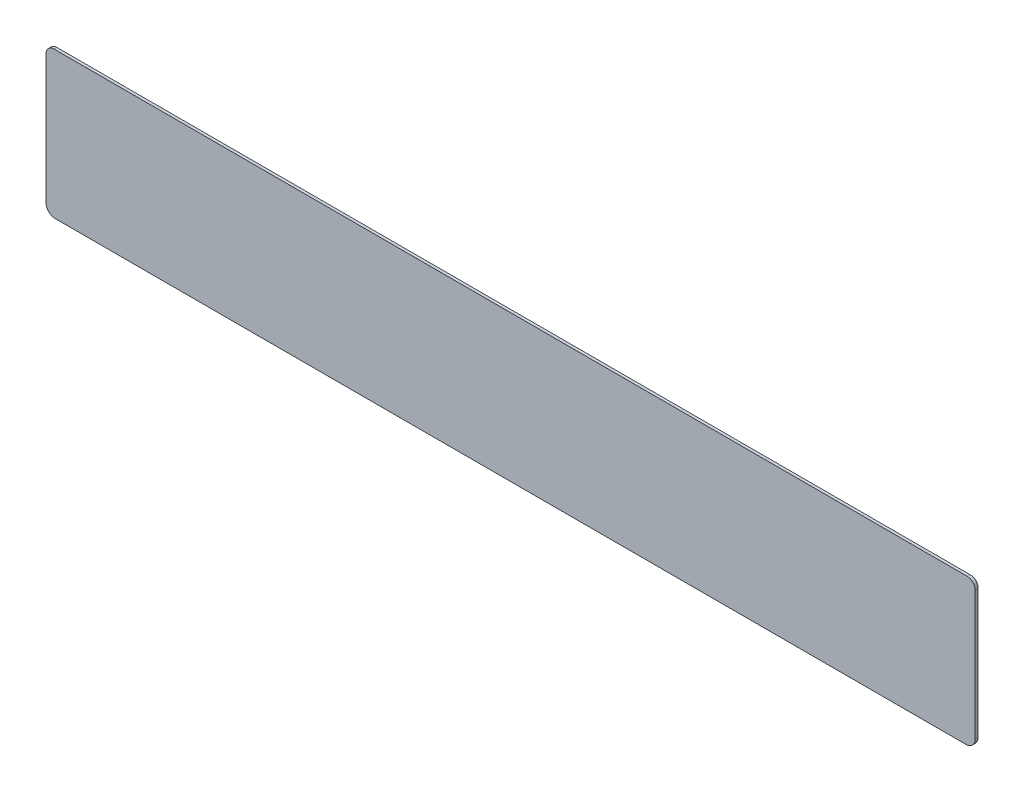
ISO-10303-21;
HEADER;
FILE_DESCRIPTION(('STEP AP214'),'2;1');
FILE_NAME('part.step','',(''),(''),'','','');
FILE_SCHEMA(('AUTOMOTIVE_DESIGN { 1 0 10303 214 1 1 1 1 }'));
ENDSEC;
DATA;
#1=APPLICATION_CONTEXT('core data for automotive mechanical design processes');
#2=APPLICATION_PROTOCOL_DEFINITION('international standard','automotive_design',2000,#1);
#3=PRODUCT_CONTEXT('',#1,'mechanical');
#4=PRODUCT('Part','Part','',(#3));
#5=PRODUCT_RELATED_PRODUCT_CATEGORY('part','',(#4));
#6=PRODUCT_DEFINITION_FORMATION('','',#4);
#7=PRODUCT_DEFINITION_CONTEXT('part definition',#1,'design');
#8=PRODUCT_DEFINITION('design','',#6,#7);
#9=PRODUCT_DEFINITION_SHAPE('','',#8);
#10=(LENGTH_UNIT() NAMED_UNIT(*) SI_UNIT(.MILLI.,.METRE.));
#11=(NAMED_UNIT(*) PLANE_ANGLE_UNIT() SI_UNIT($,.RADIAN.));
#12=(NAMED_UNIT(*) SI_UNIT($,.STERADIAN.) SOLID_ANGLE_UNIT());
#13=UNCERTAINTY_MEASURE_WITH_UNIT(LENGTH_MEASURE(1.E-05),#10,'distance_accuracy_value','');
#14=(GEOMETRIC_REPRESENTATION_CONTEXT(3) GLOBAL_UNCERTAINTY_ASSIGNED_CONTEXT((#13)) GLOBAL_UNIT_ASSIGNED_CONTEXT((#10,
#11,#12)) REPRESENTATION_CONTEXT('',''));
#15=CARTESIAN_POINT('',(0.,0.,0.));
#16=DIRECTION('',(0.,0.,1.));
#17=DIRECTION('',(1.,0.,0.));
#18=AXIS2_PLACEMENT_3D('',#15,#16,#17);
#19=CARTESIAN_POINT('',(100.,4.,-63.7056767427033));
#20=DIRECTION('',(0.,0.,1.));
#21=DIRECTION('',(1.,0.,0.));
#22=AXIS2_PLACEMENT_3D('',#19,#20,#21);
#23=CYLINDRICAL_SURFACE('',#22,15.5);
#24=DIRECTION('',(0.,0.,1.));
#25=VECTOR('',#24,1.);
#26=CARTESIAN_POINT('',(114.7,-0.915282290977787,11.2369375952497));
#27=LINE('',#26,#25);
#28=CARTESIAN_POINT('',(114.7,-0.915282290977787,21.1));
#29=VERTEX_POINT('',#28);
#30=CARTESIAN_POINT('',(114.7,-0.915282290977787,21.3));
#31=VERTEX_POINT('',#30);
#32=EDGE_CURVE('E295',#29,#31,#27,.T.);
#33=ORIENTED_EDGE('',*,*,#32,.F.);
#34=CARTESIAN_POINT('',(100.,4.,21.1));
#35=DIRECTION('',(0.,0.,-1.));
#36=DIRECTION('',(-1.,0.,0.));
#37=AXIS2_PLACEMENT_3D('',#34,#35,#36);
#38=CIRCLE('',#37,15.5);
#39=CARTESIAN_POINT('',(109.289001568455,-8.40824120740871,21.1));
#40=VERTEX_POINT('',#39);
#41=EDGE_CURVE('E284',#29,#40,#38,.T.);
#42=ORIENTED_EDGE('',*,*,#41,.T.);
#43=DIRECTION('',(0.,0.,1.));
#44=VECTOR('',#43,1.);
#45=CARTESIAN_POINT('',(109.289001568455,-8.40824120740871,-63.7056767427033));
#46=LINE('',#45,#44);
#47=CARTESIAN_POINT('',(109.289001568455,-8.40824120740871,21.3));
#48=VERTEX_POINT('',#47);
#49=EDGE_CURVE('E481',#40,#48,#46,.T.);
#50=ORIENTED_EDGE('',*,*,#49,.T.);
#51=CARTESIAN_POINT('',(100.,4.,21.3));
#52=DIRECTION('',(0.,0.,-1.));
#53=DIRECTION('',(1.,0.,0.));
#54=AXIS2_PLACEMENT_3D('',#51,#52,#53);
#55=CIRCLE('',#54,15.5);
#56=EDGE_CURVE('E71',#31,#48,#55,.T.);
#57=ORIENTED_EDGE('',*,*,#56,.F.);
#58=EDGE_LOOP('',(#33,#42,#50,#57));
#59=FACE_BOUND('',#58,.T.);
#60=ADVANCED_FACE('F55',(#59),#23,.F.);
#61=CARTESIAN_POINT('',(111.307177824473,-8.80717782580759,21.1));
#62=DIRECTION('',(0.,1.,0.));
#63=DIRECTION('',(-1.,0.,0.));
#64=AXIS2_PLACEMENT_3D('',#61,#62,#63);
#65=PLANE('',#64);
#66=DIRECTION('',(-1.,0.,0.));
#67=VECTOR('',#66,1.);
#68=CARTESIAN_POINT('',(111.307177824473,-8.80717782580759,21.3));
#69=LINE('',#68,#67);
#70=CARTESIAN_POINT('',(108.090420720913,-8.80717782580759,21.3));
#71=VERTEX_POINT('',#70);
#72=CARTESIAN_POINT('',(91.9095792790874,-8.80717782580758,21.3));
#73=VERTEX_POINT('',#72);
#74=EDGE_CURVE('E448',#71,#73,#69,.T.);
#75=ORIENTED_EDGE('',*,*,#74,.F.);
#76=DIRECTION('',(0.,0.,-1.));
#77=VECTOR('',#76,1.);
#78=CARTESIAN_POINT('',(108.090420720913,-8.80717782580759,21.1));
#79=LINE('',#78,#77);
#80=CARTESIAN_POINT('',(108.090420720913,-8.80717782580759,21.1));
#81=VERTEX_POINT('',#80);
#82=EDGE_CURVE('E488',#71,#81,#79,.T.);
#83=ORIENTED_EDGE('',*,*,#82,.T.);
#84=DIRECTION('',(-1.,0.,0.));
#85=VECTOR('',#84,1.);
#86=CARTESIAN_POINT('',(111.307177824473,-8.80717782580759,21.1));
#87=LINE('',#86,#85);
#88=CARTESIAN_POINT('',(91.9095792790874,-8.80717782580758,21.1));
#89=VERTEX_POINT('',#88);
#90=EDGE_CURVE('E454',#81,#89,#87,.T.);
#91=ORIENTED_EDGE('',*,*,#90,.T.);
#92=DIRECTION('',(0.,0.,-1.));
#93=VECTOR('',#92,1.);
#94=CARTESIAN_POINT('',(91.9095792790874,-8.80717782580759,21.3));
#95=LINE('',#94,#93);
#96=EDGE_CURVE('E484',#89,#73,#95,.F.);
#97=ORIENTED_EDGE('',*,*,#96,.T.);
#98=EDGE_LOOP('',(#75,#83,#91,#97));
#99=FACE_BOUND('',#98,.T.);
#100=ADVANCED_FACE('F679',(#99),#65,.T.);
#101=CARTESIAN_POINT('',(-69.3071778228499,16.8071778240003,21.1));
#102=DIRECTION('',(0.,-1.,0.));
#103=DIRECTION('',(1.,0.,0.));
#104=AXIS2_PLACEMENT_3D('',#101,#102,#103);
#105=PLANE('',#104);
#106=DIRECTION('',(1.,0.,0.));
#107=VECTOR('',#106,1.);
#108=CARTESIAN_POINT('',(-69.3071778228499,16.8071778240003,21.3));
#109=LINE('',#108,#107);
#110=CARTESIAN_POINT('',(91.9095792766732,16.8071778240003,21.3));
#111=VERTEX_POINT('',#110);
#112=CARTESIAN_POINT('',(108.090420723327,16.8071778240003,21.3));
#113=VERTEX_POINT('',#112);
#114=EDGE_CURVE('E443',#111,#113,#109,.T.);
#115=ORIENTED_EDGE('',*,*,#114,.F.);
#116=DIRECTION('',(0.,0.,-1.));
#117=VECTOR('',#116,1.);
#118=CARTESIAN_POINT('',(91.9095792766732,16.8071778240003,21.1));
#119=LINE('',#118,#117);
#120=CARTESIAN_POINT('',(91.9095792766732,16.8071778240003,21.1));
#121=VERTEX_POINT('',#120);
#122=EDGE_CURVE('E502',#111,#121,#119,.T.);
#123=ORIENTED_EDGE('',*,*,#122,.T.);
#124=DIRECTION('',(1.,0.,0.));
#125=VECTOR('',#124,1.);
#126=CARTESIAN_POINT('',(-69.3071778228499,16.8071778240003,21.1));
#127=LINE('',#126,#125);
#128=CARTESIAN_POINT('',(108.090420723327,16.8071778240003,21.1));
#129=VERTEX_POINT('',#128);
#130=EDGE_CURVE('E449',#121,#129,#127,.T.);
#131=ORIENTED_EDGE('',*,*,#130,.T.);
#132=DIRECTION('',(0.,0.,-1.));
#133=VECTOR('',#132,1.);
#134=CARTESIAN_POINT('',(108.090420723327,16.8071778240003,21.3));
#135=LINE('',#134,#133);
#136=EDGE_CURVE('E498',#129,#113,#135,.F.);
#137=ORIENTED_EDGE('',*,*,#136,.T.);
#138=EDGE_LOOP('',(#115,#123,#131,#137));
#139=FACE_BOUND('',#138,.T.);
#140=ADVANCED_FACE('F684',(#139),#105,.T.);
#141=DIRECTION('',(-1.,0.,0.));
#142=VECTOR('',#141,1.);
#143=CARTESIAN_POINT('',(111.307177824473,-8.80717782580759,21.3));
#144=LINE('',#143,#142);
#145=CARTESIAN_POINT('',(-41.9095792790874,-8.80717782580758,21.3));
#146=VERTEX_POINT('',#145);
#147=CARTESIAN_POINT('',(-58.0904207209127,-8.80717782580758,21.3));
#148=VERTEX_POINT('',#147);
#149=EDGE_CURVE('E346',#146,#148,#144,.T.);
#150=ORIENTED_EDGE('',*,*,#149,.F.);
#151=DIRECTION('',(0.,0.,-1.));
#152=VECTOR('',#151,1.);
#153=CARTESIAN_POINT('',(-41.9095792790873,-8.80717782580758,21.1));
#154=LINE('',#153,#152);
#155=CARTESIAN_POINT('',(-41.9095792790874,-8.80717782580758,21.1));
#156=VERTEX_POINT('',#155);
#157=EDGE_CURVE('E558',#146,#156,#154,.T.);
#158=ORIENTED_EDGE('',*,*,#157,.T.);
#159=DIRECTION('',(-1.,0.,0.));
#160=VECTOR('',#159,1.);
#161=CARTESIAN_POINT('',(111.307177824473,-8.80717782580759,21.1));
#162=LINE('',#161,#160);
#163=CARTESIAN_POINT('',(-58.0904207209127,-8.80717782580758,21.1));
#164=VERTEX_POINT('',#163);
#165=EDGE_CURVE('E433',#156,#164,#162,.T.);
#166=ORIENTED_EDGE('',*,*,#165,.T.);
#167=DIRECTION('',(0.,0.,-1.));
#168=VECTOR('',#167,1.);
#169=CARTESIAN_POINT('',(-58.0904207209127,-8.80717782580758,21.3));
#170=LINE('',#169,#168);
#171=EDGE_CURVE('E554',#164,#148,#170,.F.);
#172=ORIENTED_EDGE('',*,*,#171,.T.);
#173=EDGE_LOOP('',(#150,#158,#166,#172));
#174=FACE_BOUND('',#173,.T.);
#175=ADVANCED_FACE('F645',(#174),#65,.T.);
#176=DIRECTION('',(1.,0.,0.));
#177=VECTOR('',#176,1.);
#178=CARTESIAN_POINT('',(-69.3071778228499,16.8071778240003,21.3));
#179=LINE('',#178,#177);
#180=CARTESIAN_POINT('',(-58.0904207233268,16.8071778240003,21.3));
#181=VERTEX_POINT('',#180);
#182=CARTESIAN_POINT('',(-41.9095792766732,16.8071778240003,21.3));
#183=VERTEX_POINT('',#182);
#184=EDGE_CURVE('E438',#181,#183,#179,.T.);
#185=ORIENTED_EDGE('',*,*,#184,.F.);
#186=DIRECTION('',(0.,0.,-1.));
#187=VECTOR('',#186,1.);
#188=CARTESIAN_POINT('',(-58.0904207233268,16.8071778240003,21.1));
#189=LINE('',#188,#187);
#190=CARTESIAN_POINT('',(-58.0904207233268,16.8071778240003,21.1));
#191=VERTEX_POINT('',#190);
#192=EDGE_CURVE('E544',#181,#191,#189,.T.);
#193=ORIENTED_EDGE('',*,*,#192,.T.);
#194=DIRECTION('',(1.,0.,0.));
#195=VECTOR('',#194,1.);
#196=CARTESIAN_POINT('',(-69.3071778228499,16.8071778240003,21.1));
#197=LINE('',#196,#195);
#198=CARTESIAN_POINT('',(-41.9095792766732,16.8071778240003,21.1));
#199=VERTEX_POINT('',#198);
#200=EDGE_CURVE('E382',#191,#199,#197,.T.);
#201=ORIENTED_EDGE('',*,*,#200,.T.);
#202=DIRECTION('',(0.,0.,-1.));
#203=VECTOR('',#202,1.);
#204=CARTESIAN_POINT('',(-41.9095792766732,16.8071778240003,21.3));
#205=LINE('',#204,#203);
#206=EDGE_CURVE('E540',#199,#183,#205,.F.);
#207=ORIENTED_EDGE('',*,*,#206,.T.);
#208=EDGE_LOOP('',(#185,#193,#201,#207));
#209=FACE_BOUND('',#208,.T.);
#210=ADVANCED_FACE('F663',(#209),#105,.T.);
#211=CARTESIAN_POINT('',(117.554486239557,-9.55448624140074,21.1));
#212=DIRECTION('',(0.,0.,-1.));
#213=DIRECTION('',(-1.,0.,0.));
#214=AXIS2_PLACEMENT_3D('',#211,#212,#213);
#215=PLANE('',#214);
#216=CARTESIAN_POINT('',(100.,4.,21.1));
#217=DIRECTION('',(0.,0.,-1.));
#218=DIRECTION('',(-1.,0.,0.));
#219=AXIS2_PLACEMENT_3D('',#216,#217,#218);
#220=CIRCLE('',#219,15.5);
#221=CARTESIAN_POINT('',(90.7109984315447,-8.40824120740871,21.1));
#222=VERTEX_POINT('',#221);
#223=CARTESIAN_POINT('',(90.7109984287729,16.4082412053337,21.1));
#224=VERTEX_POINT('',#223);
#225=EDGE_CURVE('E314',#222,#224,#220,.T.);
#226=ORIENTED_EDGE('',*,*,#225,.F.);
#227=CARTESIAN_POINT('',(91.9095792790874,-6.80717782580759,21.1));
#228=DIRECTION('',(0.,0.,-1.));
#229=DIRECTION('',(-1.,0.,0.));
#230=AXIS2_PLACEMENT_3D('',#227,#228,#229);
#231=CIRCLE('',#230,2.);
#232=EDGE_CURVE('E570',#222,#89,#231,.F.);
#233=ORIENTED_EDGE('',*,*,#232,.T.);
#234=ORIENTED_EDGE('',*,*,#90,.F.);
#235=CARTESIAN_POINT('',(108.090420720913,-6.80717782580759,21.1));
#236=DIRECTION('',(0.,0.,-1.));
#237=DIRECTION('',(-1.,0.,0.));
#238=AXIS2_PLACEMENT_3D('',#235,#236,#237);
#239=CIRCLE('',#238,2.);
#240=EDGE_CURVE('E564',#81,#40,#239,.F.);
#241=ORIENTED_EDGE('',*,*,#240,.T.);
#242=ORIENTED_EDGE('',*,*,#41,.F.);
#243=DIRECTION('',(0.,-1.,0.));
#244=VECTOR('',#243,1.);
#245=CARTESIAN_POINT('',(114.7,8.91528229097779,21.1));
#246=LINE('',#245,#244);
#247=CARTESIAN_POINT('',(114.7,8.91528229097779,21.1));
#248=VERTEX_POINT('',#247);
#249=EDGE_CURVE('E288',#248,#29,#246,.T.);
#250=ORIENTED_EDGE('',*,*,#249,.F.);
#251=CARTESIAN_POINT('',(109.289001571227,16.4082412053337,21.1));
#252=VERTEX_POINT('',#251);
#253=EDGE_CURVE('E275',#252,#248,#38,.T.);
#254=ORIENTED_EDGE('',*,*,#253,.F.);
#255=CARTESIAN_POINT('',(108.090420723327,14.8071778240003,21.1));
#256=DIRECTION('',(0.,0.,-1.));
#257=DIRECTION('',(-1.,0.,0.));
#258=AXIS2_PLACEMENT_3D('',#255,#256,#257);
#259=CIRCLE('',#258,2.);
#260=EDGE_CURVE('E582',#252,#129,#259,.F.);
#261=ORIENTED_EDGE('',*,*,#260,.T.);
#262=ORIENTED_EDGE('',*,*,#130,.F.);
#263=CARTESIAN_POINT('',(91.9095792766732,14.8071778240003,21.1));
#264=DIRECTION('',(0.,0.,-1.));
#265=DIRECTION('',(-1.,0.,0.));
#266=AXIS2_PLACEMENT_3D('',#263,#264,#265);
#267=CIRCLE('',#266,2.);
#268=EDGE_CURVE('E576',#121,#224,#267,.F.);
#269=ORIENTED_EDGE('',*,*,#268,.T.);
#270=EDGE_LOOP('',(#226,#233,#234,#241,#242,#250,#254,#261,#262,#269));
#271=FACE_BOUND('',#270,.T.);
#272=CARTESIAN_POINT('',(-50.,4.,21.1));
#273=DIRECTION('',(0.,0.,-1.));
#274=DIRECTION('',(-1.,0.,0.));
#275=AXIS2_PLACEMENT_3D('',#272,#273,#274);
#276=CIRCLE('',#275,15.5);
#277=CARTESIAN_POINT('',(-59.2890015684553,-8.4082412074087,21.1));
#278=VERTEX_POINT('',#277);
#279=CARTESIAN_POINT('',(-59.2890015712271,16.4082412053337,21.1));
#280=VERTEX_POINT('',#279);
#281=EDGE_CURVE('E327',#278,#280,#276,.T.);
#282=ORIENTED_EDGE('',*,*,#281,.F.);
#283=CARTESIAN_POINT('',(-58.0904207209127,-6.80717782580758,21.1));
#284=DIRECTION('',(0.,0.,-1.));
#285=DIRECTION('',(-1.,0.,0.));
#286=AXIS2_PLACEMENT_3D('',#283,#284,#285);
#287=CIRCLE('',#286,2.);
#288=EDGE_CURVE('E13',#278,#164,#287,.F.);
#289=ORIENTED_EDGE('',*,*,#288,.T.);
#290=ORIENTED_EDGE('',*,*,#165,.F.);
#291=CARTESIAN_POINT('',(-41.9095792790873,-6.80717782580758,21.1));
#292=DIRECTION('',(0.,0.,-1.));
#293=DIRECTION('',(-1.,0.,0.));
#294=AXIS2_PLACEMENT_3D('',#291,#292,#293);
#295=CIRCLE('',#294,2.);
#296=CARTESIAN_POINT('',(-40.7109984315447,-8.4082412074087,21.1));
#297=VERTEX_POINT('',#296);
#298=EDGE_CURVE('E624',#156,#297,#295,.F.);
#299=ORIENTED_EDGE('',*,*,#298,.T.);
#300=CARTESIAN_POINT('',(-50.,4.,21.1));
#301=DIRECTION('',(0.,0.,-1.));
#302=DIRECTION('',(-1.,0.,0.));
#303=AXIS2_PLACEMENT_3D('',#300,#301,#302);
#304=CIRCLE('',#303,15.5);
#305=CARTESIAN_POINT('',(-40.7109984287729,16.4082412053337,21.1));
#306=VERTEX_POINT('',#305);
#307=EDGE_CURVE('E338',#306,#297,#304,.T.);
#308=ORIENTED_EDGE('',*,*,#307,.F.);
#309=CARTESIAN_POINT('',(-41.9095792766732,14.8071778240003,21.1));
#310=DIRECTION('',(0.,0.,-1.));
#311=DIRECTION('',(-1.,0.,0.));
#312=AXIS2_PLACEMENT_3D('',#309,#310,#311);
#313=CIRCLE('',#312,2.);
#314=EDGE_CURVE('E618',#306,#199,#313,.F.);
#315=ORIENTED_EDGE('',*,*,#314,.T.);
#316=ORIENTED_EDGE('',*,*,#200,.F.);
#317=CARTESIAN_POINT('',(-58.0904207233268,14.8071778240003,21.1));
#318=DIRECTION('',(0.,0.,-1.));
#319=DIRECTION('',(-1.,0.,0.));
#320=AXIS2_PLACEMENT_3D('',#317,#318,#319);
#321=CIRCLE('',#320,2.);
#322=EDGE_CURVE('E612',#191,#280,#321,.F.);
#323=ORIENTED_EDGE('',*,*,#322,.T.);
#324=EDGE_LOOP('',(#282,#289,#290,#299,#308,#315,#316,#323));
#325=FACE_BOUND('',#324,.T.);
#326=DIRECTION('',(-1.,0.,0.));
#327=VECTOR('',#326,1.);
#328=CARTESIAN_POINT('',(111.307177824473,-8.80717782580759,21.1));
#329=LINE('',#328,#327);
#330=CARTESIAN_POINT('',(8.09042072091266,-8.80717782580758,21.1));
#331=VERTEX_POINT('',#330);
#332=CARTESIAN_POINT('',(-8.09042072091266,-8.80717782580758,21.1));
#333=VERTEX_POINT('',#332);
#334=EDGE_CURVE('E437',#331,#333,#329,.T.);
#335=ORIENTED_EDGE('',*,*,#334,.F.);
#336=CARTESIAN_POINT('',(8.09042072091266,-6.80717782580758,21.1));
#337=DIRECTION('',(0.,0.,-1.));
#338=DIRECTION('',(-1.,0.,0.));
#339=AXIS2_PLACEMENT_3D('',#336,#337,#338);
#340=CIRCLE('',#339,2.);
#341=CARTESIAN_POINT('',(9.28900156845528,-8.4082412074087,21.1));
#342=VERTEX_POINT('',#341);
#343=EDGE_CURVE('E600',#331,#342,#340,.F.);
#344=ORIENTED_EDGE('',*,*,#343,.T.);
#345=CARTESIAN_POINT('',(0.,4.,21.1));
#346=DIRECTION('',(0.,0.,-1.));
#347=DIRECTION('',(-1.,0.,0.));
#348=AXIS2_PLACEMENT_3D('',#345,#346,#347);
#349=CIRCLE('',#348,15.5);
#350=CARTESIAN_POINT('',(9.28900157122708,16.4082412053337,21.1));
#351=VERTEX_POINT('',#350);
#352=EDGE_CURVE('E316',#351,#342,#349,.T.);
#353=ORIENTED_EDGE('',*,*,#352,.F.);
#354=CARTESIAN_POINT('',(8.09042072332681,14.8071778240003,21.1));
#355=DIRECTION('',(0.,0.,-1.));
#356=DIRECTION('',(-1.,0.,0.));
#357=AXIS2_PLACEMENT_3D('',#354,#355,#356);
#358=CIRCLE('',#357,2.);
#359=CARTESIAN_POINT('',(8.09042072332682,16.8071778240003,21.1));
#360=VERTEX_POINT('',#359);
#361=EDGE_CURVE('E594',#351,#360,#358,.F.);
#362=ORIENTED_EDGE('',*,*,#361,.T.);
#363=DIRECTION('',(1.,0.,0.));
#364=VECTOR('',#363,1.);
#365=CARTESIAN_POINT('',(-69.3071778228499,16.8071778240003,21.1));
#366=LINE('',#365,#364);
#367=CARTESIAN_POINT('',(-8.09042072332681,16.8071778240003,21.1));
#368=VERTEX_POINT('',#367);
#369=EDGE_CURVE('E453',#368,#360,#366,.T.);
#370=ORIENTED_EDGE('',*,*,#369,.F.);
#371=CARTESIAN_POINT('',(-8.09042072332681,14.8071778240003,21.1));
#372=DIRECTION('',(0.,0.,-1.));
#373=DIRECTION('',(-1.,0.,0.));
#374=AXIS2_PLACEMENT_3D('',#371,#372,#373);
#375=CIRCLE('',#374,2.);
#376=CARTESIAN_POINT('',(-9.28900157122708,16.4082412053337,21.1));
#377=VERTEX_POINT('',#376);
#378=EDGE_CURVE('E588',#368,#377,#375,.F.);
#379=ORIENTED_EDGE('',*,*,#378,.T.);
#380=CARTESIAN_POINT('',(0.,4.,21.1));
#381=DIRECTION('',(0.,0.,-1.));
#382=DIRECTION('',(-1.,0.,0.));
#383=AXIS2_PLACEMENT_3D('',#380,#381,#382);
#384=CIRCLE('',#383,15.5);
#385=CARTESIAN_POINT('',(-9.28900156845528,-8.4082412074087,21.1));
#386=VERTEX_POINT('',#385);
#387=EDGE_CURVE('E342',#386,#377,#384,.T.);
#388=ORIENTED_EDGE('',*,*,#387,.F.);
#389=CARTESIAN_POINT('',(-8.09042072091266,-6.80717782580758,21.1));
#390=DIRECTION('',(0.,0.,-1.));
#391=DIRECTION('',(-1.,0.,0.));
#392=AXIS2_PLACEMENT_3D('',#389,#390,#391);
#393=CIRCLE('',#392,2.);
#394=EDGE_CURVE('E606',#386,#333,#393,.F.);
#395=ORIENTED_EDGE('',*,*,#394,.T.);
#396=EDGE_LOOP('',(#335,#344,#353,#362,#370,#379,#388,#395));
#397=FACE_BOUND('',#396,.T.);
#398=CARTESIAN_POINT('',(117.554486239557,-9.55448624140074,21.1));
#399=DIRECTION('',(0.,0.,-1.));
#400=DIRECTION('',(-1.,0.,0.));
#401=AXIS2_PLACEMENT_3D('',#398,#399,#400);
#402=CIRCLE('',#401,1.75269158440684);
#403=CARTESIAN_POINT('',(119.307177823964,-9.55448624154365,21.1));
#404=VERTEX_POINT('',#403);
#405=CARTESIAN_POINT('',(117.554486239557,-11.3071778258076,21.1));
#406=VERTEX_POINT('',#405);
#407=EDGE_CURVE('E350',#404,#406,#402,.T.);
#408=ORIENTED_EDGE('',*,*,#407,.T.);
#409=DIRECTION('',(-1.,0.,0.));
#410=VECTOR('',#409,1.);
#411=CARTESIAN_POINT('',(117.554486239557,-11.3071778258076,21.1));
#412=LINE('',#411,#410);
#413=CARTESIAN_POINT('',(-75.5544862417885,-11.3071778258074,21.1));
#414=VERTEX_POINT('',#413);
#415=EDGE_CURVE('E354',#406,#414,#412,.T.);
#416=ORIENTED_EDGE('',*,*,#415,.T.);
#417=CARTESIAN_POINT('',(-75.5544862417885,-9.55448624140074,21.1));
#418=DIRECTION('',(0.,0.,-1.));
#419=DIRECTION('',(-1.,0.,0.));
#420=AXIS2_PLACEMENT_3D('',#417,#418,#419);
#421=CIRCLE('',#420,1.75269158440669);
#422=CARTESIAN_POINT('',(-77.3071778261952,-9.55448624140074,21.1));
#423=VERTEX_POINT('',#422);
#424=EDGE_CURVE('E358',#414,#423,#421,.T.);
#425=ORIENTED_EDGE('',*,*,#424,.T.);
#426=DIRECTION('',(1.60353780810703E-10,1.,0.));
#427=VECTOR('',#426,1.);
#428=CARTESIAN_POINT('',(-77.3071778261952,-9.55448624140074,21.1));
#429=LINE('',#428,#427);
#430=CARTESIAN_POINT('',(-77.3071778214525,17.8111563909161,21.1));
#431=VERTEX_POINT('',#430);
#432=EDGE_CURVE('E361',#423,#431,#429,.T.);
#433=ORIENTED_EDGE('',*,*,#432,.T.);
#434=CARTESIAN_POINT('',(-75.8111563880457,17.8111563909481,21.1));
#435=DIRECTION('',(0.,0.,-1.));
#436=DIRECTION('',(-1.,0.,0.));
#437=AXIS2_PLACEMENT_3D('',#434,#435,#436);
#438=CIRCLE('',#437,1.49602143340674);
#439=CARTESIAN_POINT('',(-75.8111563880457,19.3071778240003,21.1));
#440=VERTEX_POINT('',#439);
#441=EDGE_CURVE('E364',#431,#440,#438,.T.);
#442=ORIENTED_EDGE('',*,*,#441,.T.);
#443=DIRECTION('',(1.,-3.66249654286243E-12,0.));
#444=VECTOR('',#443,1.);
#445=CARTESIAN_POINT('',(-75.8111563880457,19.3071778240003,21.1));
#446=LINE('',#445,#444);
#447=CARTESIAN_POINT('',(117.811164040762,19.3071778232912,21.1));
#448=VERTEX_POINT('',#447);
#449=EDGE_CURVE('E367',#440,#448,#446,.T.);
#450=ORIENTED_EDGE('',*,*,#449,.T.);
#451=CARTESIAN_POINT('',(117.811164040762,17.8111640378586,21.1));
#452=DIRECTION('',(0.,0.,-1.));
#453=DIRECTION('',(-1.,0.,0.));
#454=AXIS2_PLACEMENT_3D('',#451,#452,#453);
#455=CIRCLE('',#454,1.49601378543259);
#456=CARTESIAN_POINT('',(119.307177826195,17.8111640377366,21.1));
#457=VERTEX_POINT('',#456);
#458=EDGE_CURVE('E370',#448,#457,#455,.T.);
#459=ORIENTED_EDGE('',*,*,#458,.T.);
#460=DIRECTION('',(-8.1508069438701E-11,-1.,0.));
#461=VECTOR('',#460,1.);
#462=CARTESIAN_POINT('',(119.307177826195,17.8111640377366,21.1));
#463=LINE('',#462,#461);
#464=EDGE_CURVE('E373',#457,#404,#463,.T.);
#465=ORIENTED_EDGE('',*,*,#464,.T.);
#466=EDGE_LOOP('',(#408,#416,#425,#433,#442,#450,#459,#465));
#467=FACE_BOUND('',#466,.T.);
#468=ADVANCED_FACE('F290',(#271,#325,#397,#467),#215,.T.);
#469=CARTESIAN_POINT('',(117.554486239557,-9.55448624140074,21.3));
#470=DIRECTION('',(0.,0.,-1.));
#471=DIRECTION('',(-1.,0.,0.));
#472=AXIS2_PLACEMENT_3D('',#469,#470,#471);
#473=PLANE('',#472);
#474=CARTESIAN_POINT('',(109.289001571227,16.4082412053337,21.3));
#475=VERTEX_POINT('',#474);
#476=CARTESIAN_POINT('',(114.7,8.91528229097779,21.3));
#477=VERTEX_POINT('',#476);
#478=EDGE_CURVE('E331',#475,#477,#55,.T.);
#479=ORIENTED_EDGE('',*,*,#478,.T.);
#480=DIRECTION('',(0.,-1.,0.));
#481=VECTOR('',#480,1.);
#482=CARTESIAN_POINT('',(114.7,8.91528229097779,21.3));
#483=LINE('',#482,#481);
#484=EDGE_CURVE('E296',#477,#31,#483,.T.);
#485=ORIENTED_EDGE('',*,*,#484,.T.);
#486=ORIENTED_EDGE('',*,*,#56,.T.);
#487=CARTESIAN_POINT('',(108.090420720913,-6.80717782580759,21.3));
#488=DIRECTION('',(0.,0.,-1.));
#489=DIRECTION('',(-1.,0.,0.));
#490=AXIS2_PLACEMENT_3D('',#487,#488,#489);
#491=CIRCLE('',#490,2.);
#492=EDGE_CURVE('E561',#48,#71,#491,.T.);
#493=ORIENTED_EDGE('',*,*,#492,.T.);
#494=ORIENTED_EDGE('',*,*,#74,.T.);
#495=CARTESIAN_POINT('',(91.9095792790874,-6.80717782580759,21.3));
#496=DIRECTION('',(0.,0.,-1.));
#497=DIRECTION('',(-1.,0.,0.));
#498=AXIS2_PLACEMENT_3D('',#495,#496,#497);
#499=CIRCLE('',#498,2.);
#500=CARTESIAN_POINT('',(90.7109984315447,-8.40824120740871,21.3));
#501=VERTEX_POINT('',#500);
#502=EDGE_CURVE('E567',#73,#501,#499,.T.);
#503=ORIENTED_EDGE('',*,*,#502,.T.);
#504=CARTESIAN_POINT('',(100.,4.,21.3));
#505=DIRECTION('',(0.,0.,-1.));
#506=DIRECTION('',(1.,0.,0.));
#507=AXIS2_PLACEMENT_3D('',#504,#505,#506);
#508=CIRCLE('',#507,15.5);
#509=CARTESIAN_POINT('',(90.7109984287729,16.4082412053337,21.3));
#510=VERTEX_POINT('',#509);
#511=EDGE_CURVE('E308',#501,#510,#508,.T.);
#512=ORIENTED_EDGE('',*,*,#511,.T.);
#513=CARTESIAN_POINT('',(91.9095792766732,14.8071778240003,21.3));
#514=DIRECTION('',(0.,0.,-1.));
#515=DIRECTION('',(-1.,0.,0.));
#516=AXIS2_PLACEMENT_3D('',#513,#514,#515);
#517=CIRCLE('',#516,2.);
#518=EDGE_CURVE('E573',#510,#111,#517,.T.);
#519=ORIENTED_EDGE('',*,*,#518,.T.);
#520=ORIENTED_EDGE('',*,*,#114,.T.);
#521=CARTESIAN_POINT('',(108.090420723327,14.8071778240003,21.3));
#522=DIRECTION('',(0.,0.,-1.));
#523=DIRECTION('',(-1.,0.,0.));
#524=AXIS2_PLACEMENT_3D('',#521,#522,#523);
#525=CIRCLE('',#524,2.);
#526=EDGE_CURVE('E579',#113,#475,#525,.T.);
#527=ORIENTED_EDGE('',*,*,#526,.T.);
#528=EDGE_LOOP('',(#479,#485,#486,#493,#494,#503,#512,#519,#520,#527));
#529=FACE_BOUND('',#528,.T.);
#530=CARTESIAN_POINT('',(-50.,4.,21.3));
#531=DIRECTION('',(0.,0.,-1.));
#532=DIRECTION('',(1.,0.,0.));
#533=AXIS2_PLACEMENT_3D('',#530,#531,#532);
#534=CIRCLE('',#533,15.5);
#535=CARTESIAN_POINT('',(-40.7109984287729,16.4082412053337,21.3));
#536=VERTEX_POINT('',#535);
#537=CARTESIAN_POINT('',(-40.7109984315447,-8.4082412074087,21.3));
#538=VERTEX_POINT('',#537);
#539=EDGE_CURVE('E334',#536,#538,#534,.T.);
#540=ORIENTED_EDGE('',*,*,#539,.T.);
#541=CARTESIAN_POINT('',(-41.9095792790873,-6.80717782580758,21.3));
#542=DIRECTION('',(0.,0.,-1.));
#543=DIRECTION('',(-1.,0.,0.));
#544=AXIS2_PLACEMENT_3D('',#541,#542,#543);
#545=CIRCLE('',#544,2.);
#546=EDGE_CURVE('E621',#538,#146,#545,.T.);
#547=ORIENTED_EDGE('',*,*,#546,.T.);
#548=ORIENTED_EDGE('',*,*,#149,.T.);
#549=CARTESIAN_POINT('',(-58.0904207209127,-6.80717782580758,21.3));
#550=DIRECTION('',(0.,0.,-1.));
#551=DIRECTION('',(-1.,0.,0.));
#552=AXIS2_PLACEMENT_3D('',#549,#550,#551);
#553=CIRCLE('',#552,2.);
#554=CARTESIAN_POINT('',(-59.2890015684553,-8.4082412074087,21.3));
#555=VERTEX_POINT('',#554);
#556=EDGE_CURVE('E64',#148,#555,#553,.T.);
#557=ORIENTED_EDGE('',*,*,#556,.T.);
#558=CARTESIAN_POINT('',(-50.,4.,21.3));
#559=DIRECTION('',(0.,0.,-1.));
#560=DIRECTION('',(1.,0.,0.));
#561=AXIS2_PLACEMENT_3D('',#558,#559,#560);
#562=CIRCLE('',#561,15.5);
#563=CARTESIAN_POINT('',(-59.2890015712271,16.4082412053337,21.3));
#564=VERTEX_POINT('',#563);
#565=EDGE_CURVE('E320',#555,#564,#562,.T.);
#566=ORIENTED_EDGE('',*,*,#565,.T.);
#567=CARTESIAN_POINT('',(-58.0904207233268,14.8071778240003,21.3));
#568=DIRECTION('',(0.,0.,-1.));
#569=DIRECTION('',(-1.,0.,0.));
#570=AXIS2_PLACEMENT_3D('',#567,#568,#569);
#571=CIRCLE('',#570,2.);
#572=EDGE_CURVE('E609',#564,#181,#571,.T.);
#573=ORIENTED_EDGE('',*,*,#572,.T.);
#574=ORIENTED_EDGE('',*,*,#184,.T.);
#575=CARTESIAN_POINT('',(-41.9095792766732,14.8071778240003,21.3));
#576=DIRECTION('',(0.,0.,-1.));
#577=DIRECTION('',(-1.,0.,0.));
#578=AXIS2_PLACEMENT_3D('',#575,#576,#577);
#579=CIRCLE('',#578,2.);
#580=EDGE_CURVE('E615',#183,#536,#579,.T.);
#581=ORIENTED_EDGE('',*,*,#580,.T.);
#582=EDGE_LOOP('',(#540,#547,#548,#557,#566,#573,#574,#581));
#583=FACE_BOUND('',#582,.T.);
#584=DIRECTION('',(1.,0.,0.));
#585=VECTOR('',#584,1.);
#586=CARTESIAN_POINT('',(-69.3071778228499,16.8071778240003,21.3));
#587=LINE('',#586,#585);
#588=CARTESIAN_POINT('',(-8.09042072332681,16.8071778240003,21.3));
#589=VERTEX_POINT('',#588);
#590=CARTESIAN_POINT('',(8.09042072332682,16.8071778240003,21.3));
#591=VERTEX_POINT('',#590);
#592=EDGE_CURVE('E447',#589,#591,#587,.T.);
#593=ORIENTED_EDGE('',*,*,#592,.T.);
#594=CARTESIAN_POINT('',(8.09042072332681,14.8071778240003,21.3));
#595=DIRECTION('',(0.,0.,-1.));
#596=DIRECTION('',(-1.,0.,0.));
#597=AXIS2_PLACEMENT_3D('',#594,#595,#596);
#598=CIRCLE('',#597,2.);
#599=CARTESIAN_POINT('',(9.28900157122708,16.4082412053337,21.3));
#600=VERTEX_POINT('',#599);
#601=EDGE_CURVE('E591',#591,#600,#598,.T.);
#602=ORIENTED_EDGE('',*,*,#601,.T.);
#603=CARTESIAN_POINT('',(0.,4.,21.3));
#604=DIRECTION('',(0.,0.,-1.));
#605=DIRECTION('',(1.,0.,0.));
#606=AXIS2_PLACEMENT_3D('',#603,#604,#605);
#607=CIRCLE('',#606,15.5);
#608=CARTESIAN_POINT('',(9.28900156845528,-8.4082412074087,21.3));
#609=VERTEX_POINT('',#608);
#610=EDGE_CURVE('E302',#600,#609,#607,.T.);
#611=ORIENTED_EDGE('',*,*,#610,.T.);
#612=CARTESIAN_POINT('',(8.09042072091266,-6.80717782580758,21.3));
#613=DIRECTION('',(0.,0.,-1.));
#614=DIRECTION('',(-1.,0.,0.));
#615=AXIS2_PLACEMENT_3D('',#612,#613,#614);
#616=CIRCLE('',#615,2.);
#617=CARTESIAN_POINT('',(8.09042072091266,-8.80717782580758,21.3));
#618=VERTEX_POINT('',#617);
#619=EDGE_CURVE('E597',#609,#618,#616,.T.);
#620=ORIENTED_EDGE('',*,*,#619,.T.);
#621=DIRECTION('',(-1.,0.,0.));
#622=VECTOR('',#621,1.);
#623=CARTESIAN_POINT('',(111.307177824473,-8.80717782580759,21.3));
#624=LINE('',#623,#622);
#625=CARTESIAN_POINT('',(-8.09042072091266,-8.80717782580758,21.3));
#626=VERTEX_POINT('',#625);
#627=EDGE_CURVE('E442',#618,#626,#624,.T.);
#628=ORIENTED_EDGE('',*,*,#627,.T.);
#629=CARTESIAN_POINT('',(-8.09042072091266,-6.80717782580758,21.3));
#630=DIRECTION('',(0.,0.,-1.));
#631=DIRECTION('',(-1.,0.,0.));
#632=AXIS2_PLACEMENT_3D('',#629,#630,#631);
#633=CIRCLE('',#632,2.);
#634=CARTESIAN_POINT('',(-9.28900156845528,-8.4082412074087,21.3));
#635=VERTEX_POINT('',#634);
#636=EDGE_CURVE('E603',#626,#635,#633,.T.);
#637=ORIENTED_EDGE('',*,*,#636,.T.);
#638=CARTESIAN_POINT('',(0.,4.,21.3));
#639=DIRECTION('',(0.,0.,-1.));
#640=DIRECTION('',(1.,0.,0.));
#641=AXIS2_PLACEMENT_3D('',#638,#639,#640);
#642=CIRCLE('',#641,15.5);
#643=CARTESIAN_POINT('',(-9.28900157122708,16.4082412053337,21.3));
#644=VERTEX_POINT('',#643);
#645=EDGE_CURVE('E283',#635,#644,#642,.T.);
#646=ORIENTED_EDGE('',*,*,#645,.T.);
#647=CARTESIAN_POINT('',(-8.09042072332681,14.8071778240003,21.3));
#648=DIRECTION('',(0.,0.,-1.));
#649=DIRECTION('',(-1.,0.,0.));
#650=AXIS2_PLACEMENT_3D('',#647,#648,#649);
#651=CIRCLE('',#650,2.);
#652=EDGE_CURVE('E585',#644,#589,#651,.T.);
#653=ORIENTED_EDGE('',*,*,#652,.T.);
#654=EDGE_LOOP('',(#593,#602,#611,#620,#628,#637,#646,#653));
#655=FACE_BOUND('',#654,.T.);
#656=CARTESIAN_POINT('',(117.554486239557,-9.55448624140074,21.3));
#657=DIRECTION('',(0.,0.,-1.));
#658=DIRECTION('',(-1.,0.,0.));
#659=AXIS2_PLACEMENT_3D('',#656,#657,#658);
#660=CIRCLE('',#659,1.75269158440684);
#661=CARTESIAN_POINT('',(119.307177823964,-9.55448624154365,21.3));
#662=VERTEX_POINT('',#661);
#663=CARTESIAN_POINT('',(117.554486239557,-11.3071778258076,21.3));
#664=VERTEX_POINT('',#663);
#665=EDGE_CURVE('E377',#662,#664,#660,.T.);
#666=ORIENTED_EDGE('',*,*,#665,.F.);
#667=DIRECTION('',(-8.1508069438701E-11,-1.,0.));
#668=VECTOR('',#667,1.);
#669=CARTESIAN_POINT('',(119.307177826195,17.8111640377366,21.3));
#670=LINE('',#669,#668);
#671=CARTESIAN_POINT('',(119.307177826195,17.8111640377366,21.3));
#672=VERTEX_POINT('',#671);
#673=EDGE_CURVE('E355',#672,#662,#670,.T.);
#674=ORIENTED_EDGE('',*,*,#673,.F.);
#675=CARTESIAN_POINT('',(117.811164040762,17.8111640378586,21.3));
#676=DIRECTION('',(0.,0.,-1.));
#677=DIRECTION('',(-1.,0.,0.));
#678=AXIS2_PLACEMENT_3D('',#675,#676,#677);
#679=CIRCLE('',#678,1.49601378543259);
#680=CARTESIAN_POINT('',(117.811164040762,19.3071778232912,21.3));
#681=VERTEX_POINT('',#680);
#682=EDGE_CURVE('E397',#681,#672,#679,.T.);
#683=ORIENTED_EDGE('',*,*,#682,.F.);
#684=DIRECTION('',(1.,-3.66249654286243E-12,0.));
#685=VECTOR('',#684,1.);
#686=CARTESIAN_POINT('',(-75.8111563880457,19.3071778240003,21.3));
#687=LINE('',#686,#685);
#688=CARTESIAN_POINT('',(-75.8111563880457,19.3071778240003,21.3));
#689=VERTEX_POINT('',#688);
#690=EDGE_CURVE('E394',#689,#681,#687,.T.);
#691=ORIENTED_EDGE('',*,*,#690,.F.);
#692=CARTESIAN_POINT('',(-75.8111563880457,17.8111563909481,21.3));
#693=DIRECTION('',(0.,0.,-1.));
#694=DIRECTION('',(-1.,0.,0.));
#695=AXIS2_PLACEMENT_3D('',#692,#693,#694);
#696=CIRCLE('',#695,1.49602143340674);
#697=CARTESIAN_POINT('',(-77.3071778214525,17.8111563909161,21.3));
#698=VERTEX_POINT('',#697);
#699=EDGE_CURVE('E391',#698,#689,#696,.T.);
#700=ORIENTED_EDGE('',*,*,#699,.F.);
#701=DIRECTION('',(1.60353780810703E-10,1.,0.));
#702=VECTOR('',#701,1.);
#703=CARTESIAN_POINT('',(-77.3071778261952,-9.55448624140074,21.3));
#704=LINE('',#703,#702);
#705=CARTESIAN_POINT('',(-77.3071778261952,-9.55448624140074,21.3));
#706=VERTEX_POINT('',#705);
#707=EDGE_CURVE('E388',#706,#698,#704,.T.);
#708=ORIENTED_EDGE('',*,*,#707,.F.);
#709=CARTESIAN_POINT('',(-75.5544862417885,-9.55448624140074,21.3));
#710=DIRECTION('',(0.,0.,-1.));
#711=DIRECTION('',(-1.,0.,0.));
#712=AXIS2_PLACEMENT_3D('',#709,#710,#711);
#713=CIRCLE('',#712,1.75269158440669);
#714=CARTESIAN_POINT('',(-75.5544862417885,-11.3071778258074,21.3));
#715=VERTEX_POINT('',#714);
#716=EDGE_CURVE('E385',#715,#706,#713,.T.);
#717=ORIENTED_EDGE('',*,*,#716,.F.);
#718=DIRECTION('',(-1.,0.,0.));
#719=VECTOR('',#718,1.);
#720=CARTESIAN_POINT('',(117.554486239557,-11.3071778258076,21.3));
#721=LINE('',#720,#719);
#722=EDGE_CURVE('E381',#664,#715,#721,.T.);
#723=ORIENTED_EDGE('',*,*,#722,.F.);
#724=EDGE_LOOP('',(#666,#674,#683,#691,#700,#708,#717,#723));
#725=FACE_BOUND('',#724,.T.);
#726=ADVANCED_FACE('F630',(#529,#583,#655,#725),#473,.F.);
#727=CARTESIAN_POINT('',(117.554486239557,-9.55448624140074,21.1));
#728=DIRECTION('',(0.,0.,1.));
#729=DIRECTION('',(1.,0.,0.));
#730=AXIS2_PLACEMENT_3D('',#727,#728,#729);
#731=CYLINDRICAL_SURFACE('',#730,1.75269158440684);
#732=ORIENTED_EDGE('',*,*,#665,.T.);
#733=DIRECTION('',(0.,0.,1.));
#734=VECTOR('',#733,1.);
#735=CARTESIAN_POINT('',(117.554486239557,-11.3071778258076,21.1));
#736=LINE('',#735,#734);
#737=EDGE_CURVE('E429',#406,#664,#736,.T.);
#738=ORIENTED_EDGE('',*,*,#737,.F.);
#739=ORIENTED_EDGE('',*,*,#407,.F.);
#740=DIRECTION('',(0.,0.,1.));
#741=VECTOR('',#740,1.);
#742=CARTESIAN_POINT('',(119.307177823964,-9.55448624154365,21.1));
#743=LINE('',#742,#741);
#744=EDGE_CURVE('E376',#404,#662,#743,.T.);
#745=ORIENTED_EDGE('',*,*,#744,.T.);
#746=EDGE_LOOP('',(#732,#738,#739,#745));
#747=FACE_BOUND('',#746,.T.);
#748=ADVANCED_FACE('F708',(#747),#731,.T.);
#749=CARTESIAN_POINT('',(117.554486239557,-11.3071778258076,21.1));
#750=DIRECTION('',(0.,1.,0.));
#751=DIRECTION('',(-1.,0.,0.));
#752=AXIS2_PLACEMENT_3D('',#749,#750,#751);
#753=PLANE('',#752);
#754=ORIENTED_EDGE('',*,*,#722,.T.);
#755=DIRECTION('',(0.,0.,1.));
#756=VECTOR('',#755,1.);
#757=CARTESIAN_POINT('',(-75.5544862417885,-11.3071778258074,21.1));
#758=LINE('',#757,#756);
#759=EDGE_CURVE('E425',#414,#715,#758,.T.);
#760=ORIENTED_EDGE('',*,*,#759,.F.);
#761=ORIENTED_EDGE('',*,*,#415,.F.);
#762=ORIENTED_EDGE('',*,*,#737,.T.);
#763=EDGE_LOOP('',(#754,#760,#761,#762));
#764=FACE_BOUND('',#763,.T.);
#765=ADVANCED_FACE('F733',(#764),#753,.F.);
#766=CARTESIAN_POINT('',(-75.5544862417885,-9.55448624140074,21.1));
#767=DIRECTION('',(0.,0.,1.));
#768=DIRECTION('',(1.,0.,0.));
#769=AXIS2_PLACEMENT_3D('',#766,#767,#768);
#770=CYLINDRICAL_SURFACE('',#769,1.75269158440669);
#771=ORIENTED_EDGE('',*,*,#716,.T.);
#772=DIRECTION('',(0.,0.,1.));
#773=VECTOR('',#772,1.);
#774=CARTESIAN_POINT('',(-77.3071778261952,-9.55448624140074,21.1));
#775=LINE('',#774,#773);
#776=EDGE_CURVE('E421',#423,#706,#775,.T.);
#777=ORIENTED_EDGE('',*,*,#776,.F.);
#778=ORIENTED_EDGE('',*,*,#424,.F.);
#779=ORIENTED_EDGE('',*,*,#759,.T.);
#780=EDGE_LOOP('',(#771,#777,#778,#779));
#781=FACE_BOUND('',#780,.T.);
#782=ADVANCED_FACE('F729',(#781),#770,.T.);
#783=CARTESIAN_POINT('',(-77.3071778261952,-9.55448624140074,21.1));
#784=DIRECTION('',(1.,-1.60353780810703E-10,0.));
#785=DIRECTION('',(1.60353780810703E-10,1.,0.));
#786=AXIS2_PLACEMENT_3D('',#783,#784,#785);
#787=PLANE('',#786);
#788=ORIENTED_EDGE('',*,*,#707,.T.);
#789=DIRECTION('',(0.,0.,1.));
#790=VECTOR('',#789,1.);
#791=CARTESIAN_POINT('',(-77.3071778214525,17.8111563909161,21.1));
#792=LINE('',#791,#790);
#793=EDGE_CURVE('E417',#431,#698,#792,.T.);
#794=ORIENTED_EDGE('',*,*,#793,.F.);
#795=ORIENTED_EDGE('',*,*,#432,.F.);
#796=ORIENTED_EDGE('',*,*,#776,.T.);
#797=EDGE_LOOP('',(#788,#794,#795,#796));
#798=FACE_BOUND('',#797,.T.);
#799=ADVANCED_FACE('F725',(#798),#787,.F.);
#800=CARTESIAN_POINT('',(-75.8111563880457,17.8111563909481,21.1));
#801=DIRECTION('',(0.,0.,1.));
#802=DIRECTION('',(1.,0.,0.));
#803=AXIS2_PLACEMENT_3D('',#800,#801,#802);
#804=CYLINDRICAL_SURFACE('',#803,1.49602143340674);
#805=ORIENTED_EDGE('',*,*,#699,.T.);
#806=DIRECTION('',(0.,0.,1.));
#807=VECTOR('',#806,1.);
#808=CARTESIAN_POINT('',(-75.8111563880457,19.3071778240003,21.1));
#809=LINE('',#808,#807);
#810=EDGE_CURVE('E413',#440,#689,#809,.T.);
#811=ORIENTED_EDGE('',*,*,#810,.F.);
#812=ORIENTED_EDGE('',*,*,#441,.F.);
#813=ORIENTED_EDGE('',*,*,#793,.T.);
#814=EDGE_LOOP('',(#805,#811,#812,#813));
#815=FACE_BOUND('',#814,.T.);
#816=ADVANCED_FACE('F721',(#815),#804,.T.);
#817=CARTESIAN_POINT('',(-75.8111563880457,19.3071778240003,21.1));
#818=DIRECTION('',(-3.66249654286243E-12,-1.,0.));
#819=DIRECTION('',(1.,-3.66249654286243E-12,0.));
#820=AXIS2_PLACEMENT_3D('',#817,#818,#819);
#821=PLANE('',#820);
#822=ORIENTED_EDGE('',*,*,#690,.T.);
#823=DIRECTION('',(0.,0.,1.));
#824=VECTOR('',#823,1.);
#825=CARTESIAN_POINT('',(117.811164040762,19.3071778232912,21.1));
#826=LINE('',#825,#824);
#827=EDGE_CURVE('E409',#448,#681,#826,.T.);
#828=ORIENTED_EDGE('',*,*,#827,.F.);
#829=ORIENTED_EDGE('',*,*,#449,.F.);
#830=ORIENTED_EDGE('',*,*,#810,.T.);
#831=EDGE_LOOP('',(#822,#828,#829,#830));
#832=FACE_BOUND('',#831,.T.);
#833=ADVANCED_FACE('F717',(#832),#821,.F.);
#834=CARTESIAN_POINT('',(117.811164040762,17.8111640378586,21.1));
#835=DIRECTION('',(0.,0.,1.));
#836=DIRECTION('',(1.,0.,0.));
#837=AXIS2_PLACEMENT_3D('',#834,#835,#836);
#838=CYLINDRICAL_SURFACE('',#837,1.49601378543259);
#839=ORIENTED_EDGE('',*,*,#682,.T.);
#840=DIRECTION('',(0.,0.,1.));
#841=VECTOR('',#840,1.);
#842=CARTESIAN_POINT('',(119.307177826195,17.8111640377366,21.1));
#843=LINE('',#842,#841);
#844=EDGE_CURVE('E405',#457,#672,#843,.T.);
#845=ORIENTED_EDGE('',*,*,#844,.F.);
#846=ORIENTED_EDGE('',*,*,#458,.F.);
#847=ORIENTED_EDGE('',*,*,#827,.T.);
#848=EDGE_LOOP('',(#839,#845,#846,#847));
#849=FACE_BOUND('',#848,.T.);
#850=ADVANCED_FACE('F713',(#849),#838,.T.);
#851=CARTESIAN_POINT('',(119.307177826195,17.8111640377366,21.1));
#852=DIRECTION('',(-1.,8.1508069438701E-11,0.));
#853=DIRECTION('',(-8.1508069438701E-11,-1.,0.));
#854=AXIS2_PLACEMENT_3D('',#851,#852,#853);
#855=PLANE('',#854);
#856=ORIENTED_EDGE('',*,*,#673,.T.);
#857=ORIENTED_EDGE('',*,*,#744,.F.);
#858=ORIENTED_EDGE('',*,*,#464,.F.);
#859=ORIENTED_EDGE('',*,*,#844,.T.);
#860=EDGE_LOOP('',(#856,#857,#858,#859));
#861=FACE_BOUND('',#860,.T.);
#862=ADVANCED_FACE('F710',(#861),#855,.F.);
#863=ORIENTED_EDGE('',*,*,#627,.F.);
#864=DIRECTION('',(0.,0.,-1.));
#865=VECTOR('',#864,1.);
#866=CARTESIAN_POINT('',(8.09042072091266,-8.80717782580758,21.1));
#867=LINE('',#866,#865);
#868=EDGE_CURVE('E530',#618,#331,#867,.T.);
#869=ORIENTED_EDGE('',*,*,#868,.T.);
#870=ORIENTED_EDGE('',*,*,#334,.T.);
#871=DIRECTION('',(0.,0.,-1.));
#872=VECTOR('',#871,1.);
#873=CARTESIAN_POINT('',(-8.09042072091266,-8.80717782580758,21.3));
#874=LINE('',#873,#872);
#875=EDGE_CURVE('E526',#333,#626,#874,.F.);
#876=ORIENTED_EDGE('',*,*,#875,.T.);
#877=EDGE_LOOP('',(#863,#869,#870,#876));
#878=FACE_BOUND('',#877,.T.);
#879=ADVANCED_FACE('F687',(#878),#65,.T.);
#880=ORIENTED_EDGE('',*,*,#592,.F.);
#881=DIRECTION('',(0.,0.,-1.));
#882=VECTOR('',#881,1.);
#883=CARTESIAN_POINT('',(-8.09042072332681,16.8071778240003,21.1));
#884=LINE('',#883,#882);
#885=EDGE_CURVE('E516',#589,#368,#884,.T.);
#886=ORIENTED_EDGE('',*,*,#885,.T.);
#887=ORIENTED_EDGE('',*,*,#369,.T.);
#888=DIRECTION('',(0.,0.,-1.));
#889=VECTOR('',#888,1.);
#890=CARTESIAN_POINT('',(8.09042072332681,16.8071778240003,21.3));
#891=LINE('',#890,#889);
#892=EDGE_CURVE('E512',#360,#591,#891,.F.);
#893=ORIENTED_EDGE('',*,*,#892,.T.);
#894=EDGE_LOOP('',(#880,#886,#887,#893));
#895=FACE_BOUND('',#894,.T.);
#896=ADVANCED_FACE('F701',(#895),#105,.T.);
#897=CARTESIAN_POINT('',(-50.,4.,-63.7056767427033));
#898=DIRECTION('',(0.,0.,1.));
#899=DIRECTION('',(1.,0.,0.));
#900=AXIS2_PLACEMENT_3D('',#897,#898,#899);
#901=CYLINDRICAL_SURFACE('',#900,15.5);
#902=ORIENTED_EDGE('',*,*,#539,.F.);
#903=DIRECTION('',(0.,0.,1.));
#904=VECTOR('',#903,1.);
#905=CARTESIAN_POINT('',(-40.7109984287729,16.4082412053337,-63.7056767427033));
#906=LINE('',#905,#904);
#907=EDGE_CURVE('E551',#536,#306,#906,.F.);
#908=ORIENTED_EDGE('',*,*,#907,.T.);
#909=ORIENTED_EDGE('',*,*,#307,.T.);
#910=DIRECTION('',(0.,0.,1.));
#911=VECTOR('',#910,1.);
#912=CARTESIAN_POINT('',(-40.7109984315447,-8.4082412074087,-63.7056767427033));
#913=LINE('',#912,#911);
#914=EDGE_CURVE('E547',#297,#538,#913,.T.);
#915=ORIENTED_EDGE('',*,*,#914,.T.);
#916=EDGE_LOOP('',(#902,#908,#909,#915));
#917=FACE_BOUND('',#916,.T.);
#918=ADVANCED_FACE('F654',(#917),#901,.F.);
#919=CARTESIAN_POINT('',(0.,4.,-63.7056767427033));
#920=DIRECTION('',(0.,0.,1.));
#921=DIRECTION('',(1.,0.,0.));
#922=AXIS2_PLACEMENT_3D('',#919,#920,#921);
#923=CYLINDRICAL_SURFACE('',#922,15.5);
#924=ORIENTED_EDGE('',*,*,#387,.T.);
#925=DIRECTION('',(0.,0.,1.));
#926=VECTOR('',#925,1.);
#927=CARTESIAN_POINT('',(-9.28900157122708,16.4082412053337,-63.7056767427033));
#928=LINE('',#927,#926);
#929=EDGE_CURVE('E508',#377,#644,#928,.T.);
#930=ORIENTED_EDGE('',*,*,#929,.T.);
#931=ORIENTED_EDGE('',*,*,#645,.F.);
#932=DIRECTION('',(0.,0.,1.));
#933=VECTOR('',#932,1.);
#934=CARTESIAN_POINT('',(-9.28900156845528,-8.4082412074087,-63.7056767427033));
#935=LINE('',#934,#933);
#936=EDGE_CURVE('E505',#635,#386,#935,.F.);
#937=ORIENTED_EDGE('',*,*,#936,.T.);
#938=EDGE_LOOP('',(#924,#930,#931,#937));
#939=FACE_BOUND('',#938,.T.);
#940=ADVANCED_FACE('F691',(#939),#923,.F.);
#941=DIRECTION('',(0.,0.,1.));
#942=VECTOR('',#941,1.);
#943=CARTESIAN_POINT('',(114.7,8.91528229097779,11.2369375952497));
#944=LINE('',#943,#942);
#945=EDGE_CURVE('E79',#248,#477,#944,.T.);
#946=ORIENTED_EDGE('',*,*,#945,.T.);
#947=ORIENTED_EDGE('',*,*,#478,.F.);
#948=DIRECTION('',(0.,0.,1.));
#949=VECTOR('',#948,1.);
#950=CARTESIAN_POINT('',(109.289001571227,16.4082412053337,-63.7056767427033));
#951=LINE('',#950,#949);
#952=EDGE_CURVE('E279',#475,#252,#951,.F.);
#953=ORIENTED_EDGE('',*,*,#952,.T.);
#954=ORIENTED_EDGE('',*,*,#253,.T.);
#955=EDGE_LOOP('',(#946,#947,#953,#954));
#956=FACE_BOUND('',#955,.T.);
#957=ADVANCED_FACE('F277',(#956),#23,.F.);
#958=CARTESIAN_POINT('',(-50.,4.,-63.7056767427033));
#959=DIRECTION('',(0.,0.,1.));
#960=DIRECTION('',(1.,0.,0.));
#961=AXIS2_PLACEMENT_3D('',#958,#959,#960);
#962=CYLINDRICAL_SURFACE('',#961,15.5);
#963=ORIENTED_EDGE('',*,*,#281,.T.);
#964=DIRECTION('',(0.,0.,1.));
#965=VECTOR('',#964,1.);
#966=CARTESIAN_POINT('',(-59.2890015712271,16.4082412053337,-63.7056767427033));
#967=LINE('',#966,#965);
#968=EDGE_CURVE('E536',#280,#564,#967,.T.);
#969=ORIENTED_EDGE('',*,*,#968,.T.);
#970=ORIENTED_EDGE('',*,*,#565,.F.);
#971=DIRECTION('',(0.,0.,1.));
#972=VECTOR('',#971,1.);
#973=CARTESIAN_POINT('',(-59.2890015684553,-8.4082412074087,-63.7056767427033));
#974=LINE('',#973,#972);
#975=EDGE_CURVE('E533',#555,#278,#974,.F.);
#976=ORIENTED_EDGE('',*,*,#975,.T.);
#977=EDGE_LOOP('',(#963,#969,#970,#976));
#978=FACE_BOUND('',#977,.T.);
#979=ADVANCED_FACE('F637',(#978),#962,.F.);
#980=CARTESIAN_POINT('',(100.,4.,-63.7056767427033));
#981=DIRECTION('',(0.,0.,1.));
#982=DIRECTION('',(1.,0.,0.));
#983=AXIS2_PLACEMENT_3D('',#980,#981,#982);
#984=CYLINDRICAL_SURFACE('',#983,15.5);
#985=ORIENTED_EDGE('',*,*,#511,.F.);
#986=DIRECTION('',(0.,0.,1.));
#987=VECTOR('',#986,1.);
#988=CARTESIAN_POINT('',(90.7109984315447,-8.40824120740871,-63.7056767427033));
#989=LINE('',#988,#987);
#990=EDGE_CURVE('E495',#501,#222,#989,.F.);
#991=ORIENTED_EDGE('',*,*,#990,.T.);
#992=ORIENTED_EDGE('',*,*,#225,.T.);
#993=DIRECTION('',(0.,0.,1.));
#994=VECTOR('',#993,1.);
#995=CARTESIAN_POINT('',(90.7109984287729,16.4082412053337,-63.7056767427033));
#996=LINE('',#995,#994);
#997=EDGE_CURVE('E491',#224,#510,#996,.T.);
#998=ORIENTED_EDGE('',*,*,#997,.T.);
#999=EDGE_LOOP('',(#985,#991,#992,#998));
#1000=FACE_BOUND('',#999,.T.);
#1001=ADVANCED_FACE('F696',(#1000),#984,.F.);
#1002=CARTESIAN_POINT('',(0.,4.,-63.7056767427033));
#1003=DIRECTION('',(0.,0.,1.));
#1004=DIRECTION('',(1.,0.,0.));
#1005=AXIS2_PLACEMENT_3D('',#1002,#1003,#1004);
#1006=CYLINDRICAL_SURFACE('',#1005,15.5);
#1007=ORIENTED_EDGE('',*,*,#610,.F.);
#1008=DIRECTION('',(0.,0.,1.));
#1009=VECTOR('',#1008,1.);
#1010=CARTESIAN_POINT('',(9.28900157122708,16.4082412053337,-63.7056767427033));
#1011=LINE('',#1010,#1009);
#1012=EDGE_CURVE('E523',#600,#351,#1011,.F.);
#1013=ORIENTED_EDGE('',*,*,#1012,.T.);
#1014=ORIENTED_EDGE('',*,*,#352,.T.);
#1015=DIRECTION('',(0.,0.,1.));
#1016=VECTOR('',#1015,1.);
#1017=CARTESIAN_POINT('',(9.28900156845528,-8.4082412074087,-63.7056767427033));
#1018=LINE('',#1017,#1016);
#1019=EDGE_CURVE('E519',#342,#609,#1018,.T.);
#1020=ORIENTED_EDGE('',*,*,#1019,.T.);
#1021=EDGE_LOOP('',(#1007,#1013,#1014,#1020));
#1022=FACE_BOUND('',#1021,.T.);
#1023=ADVANCED_FACE('F748',(#1022),#1006,.F.);
#1024=CARTESIAN_POINT('',(108.090420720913,-6.80717782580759,-63.7056767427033));
#1025=DIRECTION('',(0.,0.,1.));
#1026=DIRECTION('',(1.,0.,0.));
#1027=AXIS2_PLACEMENT_3D('',#1024,#1025,#1026);
#1028=CYLINDRICAL_SURFACE('',#1027,2.);
#1029=ORIENTED_EDGE('',*,*,#240,.F.);
#1030=ORIENTED_EDGE('',*,*,#82,.F.);
#1031=ORIENTED_EDGE('',*,*,#492,.F.);
#1032=ORIENTED_EDGE('',*,*,#49,.F.);
#1033=EDGE_LOOP('',(#1029,#1030,#1031,#1032));
#1034=FACE_BOUND('',#1033,.T.);
#1035=ADVANCED_FACE('F744',(#1034),#1028,.F.);
#1036=CARTESIAN_POINT('',(91.9095792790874,-6.80717782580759,-63.7056767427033));
#1037=DIRECTION('',(0.,0.,1.));
#1038=DIRECTION('',(1.,0.,0.));
#1039=AXIS2_PLACEMENT_3D('',#1036,#1037,#1038);
#1040=CYLINDRICAL_SURFACE('',#1039,2.);
#1041=ORIENTED_EDGE('',*,*,#232,.F.);
#1042=ORIENTED_EDGE('',*,*,#990,.F.);
#1043=ORIENTED_EDGE('',*,*,#502,.F.);
#1044=ORIENTED_EDGE('',*,*,#96,.F.);
#1045=EDGE_LOOP('',(#1041,#1042,#1043,#1044));
#1046=FACE_BOUND('',#1045,.T.);
#1047=ADVANCED_FACE('F747',(#1046),#1040,.F.);
#1048=CARTESIAN_POINT('',(91.9095792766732,14.8071778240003,-63.7056767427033));
#1049=DIRECTION('',(0.,0.,1.));
#1050=DIRECTION('',(1.,0.,0.));
#1051=AXIS2_PLACEMENT_3D('',#1048,#1049,#1050);
#1052=CYLINDRICAL_SURFACE('',#1051,2.);
#1053=ORIENTED_EDGE('',*,*,#268,.F.);
#1054=ORIENTED_EDGE('',*,*,#122,.F.);
#1055=ORIENTED_EDGE('',*,*,#518,.F.);
#1056=ORIENTED_EDGE('',*,*,#997,.F.);
#1057=EDGE_LOOP('',(#1053,#1054,#1055,#1056));
#1058=FACE_BOUND('',#1057,.T.);
#1059=ADVANCED_FACE('F752',(#1058),#1052,.F.);
#1060=CARTESIAN_POINT('',(108.090420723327,14.8071778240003,-63.7056767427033));
#1061=DIRECTION('',(0.,0.,1.));
#1062=DIRECTION('',(1.,0.,0.));
#1063=AXIS2_PLACEMENT_3D('',#1060,#1061,#1062);
#1064=CYLINDRICAL_SURFACE('',#1063,2.);
#1065=ORIENTED_EDGE('',*,*,#260,.F.);
#1066=ORIENTED_EDGE('',*,*,#952,.F.);
#1067=ORIENTED_EDGE('',*,*,#526,.F.);
#1068=ORIENTED_EDGE('',*,*,#136,.F.);
#1069=EDGE_LOOP('',(#1065,#1066,#1067,#1068));
#1070=FACE_BOUND('',#1069,.T.);
#1071=ADVANCED_FACE('F756',(#1070),#1064,.F.);
#1072=CARTESIAN_POINT('',(-8.09042072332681,14.8071778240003,-63.7056767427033));
#1073=DIRECTION('',(0.,0.,1.));
#1074=DIRECTION('',(1.,0.,0.));
#1075=AXIS2_PLACEMENT_3D('',#1072,#1073,#1074);
#1076=CYLINDRICAL_SURFACE('',#1075,2.);
#1077=ORIENTED_EDGE('',*,*,#378,.F.);
#1078=ORIENTED_EDGE('',*,*,#885,.F.);
#1079=ORIENTED_EDGE('',*,*,#652,.F.);
#1080=ORIENTED_EDGE('',*,*,#929,.F.);
#1081=EDGE_LOOP('',(#1077,#1078,#1079,#1080));
#1082=FACE_BOUND('',#1081,.T.);
#1083=ADVANCED_FACE('F760',(#1082),#1076,.F.);
#1084=CARTESIAN_POINT('',(8.09042072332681,14.8071778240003,-63.7056767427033));
#1085=DIRECTION('',(0.,0.,1.));
#1086=DIRECTION('',(1.,0.,0.));
#1087=AXIS2_PLACEMENT_3D('',#1084,#1085,#1086);
#1088=CYLINDRICAL_SURFACE('',#1087,2.);
#1089=ORIENTED_EDGE('',*,*,#361,.F.);
#1090=ORIENTED_EDGE('',*,*,#1012,.F.);
#1091=ORIENTED_EDGE('',*,*,#601,.F.);
#1092=ORIENTED_EDGE('',*,*,#892,.F.);
#1093=EDGE_LOOP('',(#1089,#1090,#1091,#1092));
#1094=FACE_BOUND('',#1093,.T.);
#1095=ADVANCED_FACE('F764',(#1094),#1088,.F.);
#1096=CARTESIAN_POINT('',(8.09042072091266,-6.80717782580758,-63.7056767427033));
#1097=DIRECTION('',(0.,0.,1.));
#1098=DIRECTION('',(1.,0.,0.));
#1099=AXIS2_PLACEMENT_3D('',#1096,#1097,#1098);
#1100=CYLINDRICAL_SURFACE('',#1099,2.);
#1101=ORIENTED_EDGE('',*,*,#343,.F.);
#1102=ORIENTED_EDGE('',*,*,#868,.F.);
#1103=ORIENTED_EDGE('',*,*,#619,.F.);
#1104=ORIENTED_EDGE('',*,*,#1019,.F.);
#1105=EDGE_LOOP('',(#1101,#1102,#1103,#1104));
#1106=FACE_BOUND('',#1105,.T.);
#1107=ADVANCED_FACE('F675',(#1106),#1100,.F.);
#1108=CARTESIAN_POINT('',(-8.09042072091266,-6.80717782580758,-63.7056767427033));
#1109=DIRECTION('',(0.,0.,1.));
#1110=DIRECTION('',(1.,0.,0.));
#1111=AXIS2_PLACEMENT_3D('',#1108,#1109,#1110);
#1112=CYLINDRICAL_SURFACE('',#1111,2.);
#1113=ORIENTED_EDGE('',*,*,#394,.F.);
#1114=ORIENTED_EDGE('',*,*,#936,.F.);
#1115=ORIENTED_EDGE('',*,*,#636,.F.);
#1116=ORIENTED_EDGE('',*,*,#875,.F.);
#1117=EDGE_LOOP('',(#1113,#1114,#1115,#1116));
#1118=FACE_BOUND('',#1117,.T.);
#1119=ADVANCED_FACE('F668',(#1118),#1112,.F.);
#1120=CARTESIAN_POINT('',(-58.0904207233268,14.8071778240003,-63.7056767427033));
#1121=DIRECTION('',(0.,0.,1.));
#1122=DIRECTION('',(1.,0.,0.));
#1123=AXIS2_PLACEMENT_3D('',#1120,#1121,#1122);
#1124=CYLINDRICAL_SURFACE('',#1123,2.);
#1125=ORIENTED_EDGE('',*,*,#322,.F.);
#1126=ORIENTED_EDGE('',*,*,#192,.F.);
#1127=ORIENTED_EDGE('',*,*,#572,.F.);
#1128=ORIENTED_EDGE('',*,*,#968,.F.);
#1129=EDGE_LOOP('',(#1125,#1126,#1127,#1128));
#1130=FACE_BOUND('',#1129,.T.);
#1131=ADVANCED_FACE('F666',(#1130),#1124,.F.);
#1132=CARTESIAN_POINT('',(-41.9095792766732,14.8071778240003,-63.7056767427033));
#1133=DIRECTION('',(0.,0.,1.));
#1134=DIRECTION('',(1.,0.,0.));
#1135=AXIS2_PLACEMENT_3D('',#1132,#1133,#1134);
#1136=CYLINDRICAL_SURFACE('',#1135,2.);
#1137=ORIENTED_EDGE('',*,*,#314,.F.);
#1138=ORIENTED_EDGE('',*,*,#907,.F.);
#1139=ORIENTED_EDGE('',*,*,#580,.F.);
#1140=ORIENTED_EDGE('',*,*,#206,.F.);
#1141=EDGE_LOOP('',(#1137,#1138,#1139,#1140));
#1142=FACE_BOUND('',#1141,.T.);
#1143=ADVANCED_FACE('F657',(#1142),#1136,.F.);
#1144=CARTESIAN_POINT('',(-41.9095792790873,-6.80717782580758,-63.7056767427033));
#1145=DIRECTION('',(0.,0.,1.));
#1146=DIRECTION('',(1.,0.,0.));
#1147=AXIS2_PLACEMENT_3D('',#1144,#1145,#1146);
#1148=CYLINDRICAL_SURFACE('',#1147,2.);
#1149=ORIENTED_EDGE('',*,*,#298,.F.);
#1150=ORIENTED_EDGE('',*,*,#157,.F.);
#1151=ORIENTED_EDGE('',*,*,#546,.F.);
#1152=ORIENTED_EDGE('',*,*,#914,.F.);
#1153=EDGE_LOOP('',(#1149,#1150,#1151,#1152));
#1154=FACE_BOUND('',#1153,.T.);
#1155=ADVANCED_FACE('F648',(#1154),#1148,.F.);
#1156=CARTESIAN_POINT('',(-58.0904207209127,-6.80717782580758,-63.7056767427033));
#1157=DIRECTION('',(0.,0.,1.));
#1158=DIRECTION('',(1.,0.,0.));
#1159=AXIS2_PLACEMENT_3D('',#1156,#1157,#1158);
#1160=CYLINDRICAL_SURFACE('',#1159,2.);
#1161=ORIENTED_EDGE('',*,*,#288,.F.);
#1162=ORIENTED_EDGE('',*,*,#975,.F.);
#1163=ORIENTED_EDGE('',*,*,#556,.F.);
#1164=ORIENTED_EDGE('',*,*,#171,.F.);
#1165=EDGE_LOOP('',(#1161,#1162,#1163,#1164));
#1166=FACE_BOUND('',#1165,.T.);
#1167=ADVANCED_FACE('F57',(#1166),#1160,.F.);
#1168=CARTESIAN_POINT('',(114.7,8.91528229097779,11.2369375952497));
#1169=DIRECTION('',(-1.,0.,0.));
#1170=DIRECTION('',(0.,0.,1.));
#1171=AXIS2_PLACEMENT_3D('',#1168,#1169,#1170);
#1172=PLANE('',#1171);
#1173=ORIENTED_EDGE('',*,*,#945,.F.);
#1174=ORIENTED_EDGE('',*,*,#249,.T.);
#1175=ORIENTED_EDGE('',*,*,#32,.T.);
#1176=ORIENTED_EDGE('',*,*,#484,.F.);
#1177=EDGE_LOOP('',(#1173,#1174,#1175,#1176));
#1178=FACE_BOUND('',#1177,.T.);
#1179=ADVANCED_FACE('F299',(#1178),#1172,.T.);
#1180=CLOSED_SHELL('',(#60,#100,#140,#175,#210,#468,#726,#748,#765,#782,#799,#816,#833,#850,
#862,#879,#896,#918,#940,#957,#979,#1001,#1023,#1035,#1047,#1059,#1071,#1083,#1095,#1107,#1119,
#1131,#1143,#1155,#1167,#1179));
#1181=MANIFOLD_SOLID_BREP('B2',#1180);
#1182=CARTESIAN_POINT('',(117.811164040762,17.8111640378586,21.9));
#1183=DIRECTION('',(0.,0.,-1.));
#1184=DIRECTION('',(-1.,0.,0.));
#1185=AXIS2_PLACEMENT_3D('',#1182,#1183,#1184);
#1186=CYLINDRICAL_SURFACE('',#1185,1.69601378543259);
#1187=CARTESIAN_POINT('',(117.811164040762,17.8111640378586,21.3));
#1188=DIRECTION('',(0.,0.,1.));
#1189=DIRECTION('',(-1.,0.,0.));
#1190=AXIS2_PLACEMENT_3D('',#1187,#1188,#1189);
#1191=CIRCLE('',#1190,1.69601378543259);
#1192=CARTESIAN_POINT('',(119.507177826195,17.8111640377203,21.3));
#1193=VERTEX_POINT('',#1192);
#1194=CARTESIAN_POINT('',(117.811164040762,19.5071778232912,21.3));
#1195=VERTEX_POINT('',#1194);
#1196=EDGE_CURVE('E1401',#1193,#1195,#1191,.T.);
#1197=ORIENTED_EDGE('',*,*,#1196,.T.);
#1198=DIRECTION('',(0.,0.,-1.));
#1199=VECTOR('',#1198,1.);
#1200=CARTESIAN_POINT('',(117.811164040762,19.5071778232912,21.9));
#1201=LINE('',#1200,#1199);
#1202=CARTESIAN_POINT('',(117.811164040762,19.5071778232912,21.9));
#1203=VERTEX_POINT('',#1202);
#1204=EDGE_CURVE('E53',#1203,#1195,#1201,.T.);
#1205=ORIENTED_EDGE('',*,*,#1204,.F.);
#1206=CARTESIAN_POINT('',(117.811164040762,17.8111640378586,21.9));
#1207=DIRECTION('',(0.,0.,1.));
#1208=DIRECTION('',(-1.,0.,0.));
#1209=AXIS2_PLACEMENT_3D('',#1206,#1207,#1208);
#1210=CIRCLE('',#1209,1.69601378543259);
#1211=CARTESIAN_POINT('',(119.507177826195,17.8111640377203,21.9));
#1212=VERTEX_POINT('',#1211);
#1213=EDGE_CURVE('E1424',#1212,#1203,#1210,.T.);
#1214=ORIENTED_EDGE('',*,*,#1213,.F.);
#1215=DIRECTION('',(0.,0.,-1.));
#1216=VECTOR('',#1215,1.);
#1217=CARTESIAN_POINT('',(119.507177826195,17.8111640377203,21.9));
#1218=LINE('',#1217,#1216);
#1219=EDGE_CURVE('E1397',#1212,#1193,#1218,.T.);
#1220=ORIENTED_EDGE('',*,*,#1219,.T.);
#1221=EDGE_LOOP('',(#1197,#1205,#1214,#1220));
#1222=FACE_BOUND('',#1221,.T.);
#1223=ADVANCED_FACE('F1299',(#1222),#1186,.T.);
#1224=CARTESIAN_POINT('',(117.811164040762,19.5071778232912,21.9));
#1225=DIRECTION('',(0.,-1.,0.));
#1226=DIRECTION('',(0.,0.,-1.));
#1227=AXIS2_PLACEMENT_3D('',#1224,#1225,#1226);
#1228=PLANE('',#1227);
#1229=DIRECTION('',(-1.,0.,0.));
#1230=VECTOR('',#1229,1.);
#1231=CARTESIAN_POINT('',(117.811164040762,19.5071778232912,21.3));
#1232=LINE('',#1231,#1230);
#1233=CARTESIAN_POINT('',(-75.8111563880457,19.5071778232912,21.3));
#1234=VERTEX_POINT('',#1233);
#1235=EDGE_CURVE('E1405',#1195,#1234,#1232,.T.);
#1236=ORIENTED_EDGE('',*,*,#1235,.T.);
#1237=DIRECTION('',(0.,0.,-1.));
#1238=VECTOR('',#1237,1.);
#1239=CARTESIAN_POINT('',(-75.8111563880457,19.5071778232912,21.9));
#1240=LINE('',#1239,#1238);
#1241=CARTESIAN_POINT('',(-75.8111563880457,19.5071778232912,21.9));
#1242=VERTEX_POINT('',#1241);
#1243=EDGE_CURVE('E1308',#1242,#1234,#1240,.T.);
#1244=ORIENTED_EDGE('',*,*,#1243,.F.);
#1245=DIRECTION('',(-1.,0.,0.));
#1246=VECTOR('',#1245,1.);
#1247=CARTESIAN_POINT('',(117.811164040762,19.5071778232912,21.9));
#1248=LINE('',#1247,#1246);
#1249=EDGE_CURVE('E1359',#1203,#1242,#1248,.T.);
#1250=ORIENTED_EDGE('',*,*,#1249,.F.);
#1251=ORIENTED_EDGE('',*,*,#1204,.T.);
#1252=EDGE_LOOP('',(#1236,#1244,#1250,#1251));
#1253=FACE_BOUND('',#1252,.T.);
#1254=ADVANCED_FACE('F1522',(#1253),#1228,.F.);
#1255=CARTESIAN_POINT('',(-75.8111563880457,17.8111563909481,21.9));
#1256=DIRECTION('',(0.,0.,-1.));
#1257=DIRECTION('',(-1.,0.,0.));
#1258=AXIS2_PLACEMENT_3D('',#1255,#1256,#1257);
#1259=CYLINDRICAL_SURFACE('',#1258,1.6960214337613);
#1260=CARTESIAN_POINT('',(-75.8111563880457,17.8111563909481,21.3));
#1261=DIRECTION('',(0.,0.,1.));
#1262=DIRECTION('',(-1.,0.,0.));
#1263=AXIS2_PLACEMENT_3D('',#1260,#1261,#1262);
#1264=CIRCLE('',#1263,1.6960214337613);
#1265=CARTESIAN_POINT('',(-77.507177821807,17.8111563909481,21.3));
#1266=VERTEX_POINT('',#1265);
#1267=EDGE_CURVE('E1409',#1234,#1266,#1264,.T.);
#1268=ORIENTED_EDGE('',*,*,#1267,.T.);
#1269=DIRECTION('',(0.,0.,-1.));
#1270=VECTOR('',#1269,1.);
#1271=CARTESIAN_POINT('',(-77.507177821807,17.8111563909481,21.9));
#1272=LINE('',#1271,#1270);
#1273=CARTESIAN_POINT('',(-77.507177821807,17.8111563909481,21.9));
#1274=VERTEX_POINT('',#1273);
#1275=EDGE_CURVE('E1435',#1274,#1266,#1272,.T.);
#1276=ORIENTED_EDGE('',*,*,#1275,.F.);
#1277=CARTESIAN_POINT('',(-75.8111563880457,17.8111563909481,21.9));
#1278=DIRECTION('',(0.,0.,1.));
#1279=DIRECTION('',(-1.,0.,0.));
#1280=AXIS2_PLACEMENT_3D('',#1277,#1278,#1279);
#1281=CIRCLE('',#1280,1.6960214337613);
#1282=EDGE_CURVE('E1446',#1242,#1274,#1281,.T.);
#1283=ORIENTED_EDGE('',*,*,#1282,.F.);
#1284=ORIENTED_EDGE('',*,*,#1243,.T.);
#1285=EDGE_LOOP('',(#1268,#1276,#1283,#1284));
#1286=FACE_BOUND('',#1285,.T.);
#1287=ADVANCED_FACE('F1444',(#1286),#1259,.T.);
#1288=CARTESIAN_POINT('',(-77.5071778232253,17.8111563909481,21.9));
#1289=DIRECTION('',(1.,-1.08527178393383E-10,0.));
#1290=DIRECTION('',(1.08527178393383E-10,1.,0.));
#1291=AXIS2_PLACEMENT_3D('',#1288,#1289,#1290);
#1292=PLANE('',#1291);
#1293=DIRECTION('',(-1.08527178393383E-10,-1.,0.));
#1294=VECTOR('',#1293,1.);
#1295=CARTESIAN_POINT('',(-77.5071778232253,17.8111563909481,21.3));
#1296=LINE('',#1295,#1294);
#1297=CARTESIAN_POINT('',(-77.5071778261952,-9.55448624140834,21.3));
#1298=VERTEX_POINT('',#1297);
#1299=EDGE_CURVE('E1412',#1266,#1298,#1296,.T.);
#1300=ORIENTED_EDGE('',*,*,#1299,.T.);
#1301=DIRECTION('',(0.,0.,-1.));
#1302=VECTOR('',#1301,1.);
#1303=CARTESIAN_POINT('',(-77.5071778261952,-9.55448624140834,21.9));
#1304=LINE('',#1303,#1302);
#1305=CARTESIAN_POINT('',(-77.5071778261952,-9.55448624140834,21.9));
#1306=VERTEX_POINT('',#1305);
#1307=EDGE_CURVE('E1431',#1306,#1298,#1304,.T.);
#1308=ORIENTED_EDGE('',*,*,#1307,.F.);
#1309=DIRECTION('',(-1.08527178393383E-10,-1.,0.));
#1310=VECTOR('',#1309,1.);
#1311=CARTESIAN_POINT('',(-77.5071778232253,17.8111563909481,21.9));
#1312=LINE('',#1311,#1310);
#1313=EDGE_CURVE('E1459',#1274,#1306,#1312,.T.);
#1314=ORIENTED_EDGE('',*,*,#1313,.F.);
#1315=ORIENTED_EDGE('',*,*,#1275,.T.);
#1316=EDGE_LOOP('',(#1300,#1308,#1314,#1315));
#1317=FACE_BOUND('',#1316,.T.);
#1318=ADVANCED_FACE('F1454',(#1317),#1292,.F.);
#1319=CARTESIAN_POINT('',(-75.5544862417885,-9.55448624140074,21.9));
#1320=DIRECTION('',(0.,0.,-1.));
#1321=DIRECTION('',(-1.,0.,0.));
#1322=AXIS2_PLACEMENT_3D('',#1319,#1320,#1321);
#1323=CYLINDRICAL_SURFACE('',#1322,1.95269158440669);
#1324=CARTESIAN_POINT('',(-75.5544862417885,-9.55448624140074,21.3));
#1325=DIRECTION('',(0.,0.,1.));
#1326=DIRECTION('',(1.,0.,0.));
#1327=AXIS2_PLACEMENT_3D('',#1324,#1325,#1326);
#1328=CIRCLE('',#1327,1.95269158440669);
#1329=CARTESIAN_POINT('',(-75.5544862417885,-11.5071778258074,21.3));
#1330=VERTEX_POINT('',#1329);
#1331=EDGE_CURVE('E1415',#1298,#1330,#1328,.T.);
#1332=ORIENTED_EDGE('',*,*,#1331,.T.);
#1333=DIRECTION('',(0.,0.,-1.));
#1334=VECTOR('',#1333,1.);
#1335=CARTESIAN_POINT('',(-75.5544862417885,-11.5071778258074,21.9));
#1336=LINE('',#1335,#1334);
#1337=CARTESIAN_POINT('',(-75.5544862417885,-11.5071778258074,21.9));
#1338=VERTEX_POINT('',#1337);
#1339=EDGE_CURVE('E1389',#1338,#1330,#1336,.T.);
#1340=ORIENTED_EDGE('',*,*,#1339,.F.);
#1341=CARTESIAN_POINT('',(-75.5544862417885,-9.55448624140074,21.9));
#1342=DIRECTION('',(0.,0.,1.));
#1343=DIRECTION('',(1.,0.,0.));
#1344=AXIS2_PLACEMENT_3D('',#1341,#1342,#1343);
#1345=CIRCLE('',#1344,1.95269158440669);
#1346=EDGE_CURVE('E1378',#1306,#1338,#1345,.T.);
#1347=ORIENTED_EDGE('',*,*,#1346,.F.);
#1348=ORIENTED_EDGE('',*,*,#1307,.T.);
#1349=EDGE_LOOP('',(#1332,#1340,#1347,#1348));
#1350=FACE_BOUND('',#1349,.T.);
#1351=ADVANCED_FACE('F1457',(#1350),#1323,.T.);
#1352=CARTESIAN_POINT('',(-75.5544862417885,-11.5071778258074,21.9));
#1353=DIRECTION('',(0.,1.,0.));
#1354=DIRECTION('',(-1.,0.,0.));
#1355=AXIS2_PLACEMENT_3D('',#1352,#1353,#1354);
#1356=PLANE('',#1355);
#1357=DIRECTION('',(1.,0.,0.));
#1358=VECTOR('',#1357,1.);
#1359=CARTESIAN_POINT('',(-75.5544862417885,-11.5071778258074,21.3));
#1360=LINE('',#1359,#1358);
#1361=CARTESIAN_POINT('',(117.554486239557,-11.5071778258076,21.3));
#1362=VERTEX_POINT('',#1361);
#1363=EDGE_CURVE('E1387',#1330,#1362,#1360,.T.);
#1364=ORIENTED_EDGE('',*,*,#1363,.T.);
#1365=DIRECTION('',(0.,0.,-1.));
#1366=VECTOR('',#1365,1.);
#1367=CARTESIAN_POINT('',(117.554486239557,-11.5071778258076,21.9));
#1368=LINE('',#1367,#1366);
#1369=CARTESIAN_POINT('',(117.554486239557,-11.5071778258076,21.9));
#1370=VERTEX_POINT('',#1369);
#1371=EDGE_CURVE('E1384',#1370,#1362,#1368,.T.);
#1372=ORIENTED_EDGE('',*,*,#1371,.F.);
#1373=DIRECTION('',(1.,0.,0.));
#1374=VECTOR('',#1373,1.);
#1375=CARTESIAN_POINT('',(-75.5544862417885,-11.5071778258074,21.9));
#1376=LINE('',#1375,#1374);
#1377=EDGE_CURVE('E1372',#1338,#1370,#1376,.T.);
#1378=ORIENTED_EDGE('',*,*,#1377,.F.);
#1379=ORIENTED_EDGE('',*,*,#1339,.T.);
#1380=EDGE_LOOP('',(#1364,#1372,#1378,#1379));
#1381=FACE_BOUND('',#1380,.T.);
#1382=ADVANCED_FACE('F1385',(#1381),#1356,.F.);
#1383=CARTESIAN_POINT('',(117.554486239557,-9.55448624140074,21.9));
#1384=DIRECTION('',(0.,0.,-1.));
#1385=DIRECTION('',(-1.,0.,0.));
#1386=AXIS2_PLACEMENT_3D('',#1383,#1384,#1385);
#1387=CYLINDRICAL_SURFACE('',#1386,1.95269158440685);
#1388=CARTESIAN_POINT('',(117.554486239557,-9.55448624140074,21.3));
#1389=DIRECTION('',(0.,0.,1.));
#1390=DIRECTION('',(1.,0.,0.));
#1391=AXIS2_PLACEMENT_3D('',#1388,#1389,#1390);
#1392=CIRCLE('',#1391,1.95269158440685);
#1393=CARTESIAN_POINT('',(119.507177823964,-9.55448624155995,21.3));
#1394=VERTEX_POINT('',#1393);
#1395=EDGE_CURVE('E1345',#1362,#1394,#1392,.T.);
#1396=ORIENTED_EDGE('',*,*,#1395,.T.);
#1397=DIRECTION('',(0.,0.,-1.));
#1398=VECTOR('',#1397,1.);
#1399=CARTESIAN_POINT('',(119.507177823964,-9.55448624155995,21.9));
#1400=LINE('',#1399,#1398);
#1401=CARTESIAN_POINT('',(119.507177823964,-9.55448624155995,21.9));
#1402=VERTEX_POINT('',#1401);
#1403=EDGE_CURVE('E1390',#1402,#1394,#1400,.T.);
#1404=ORIENTED_EDGE('',*,*,#1403,.F.);
#1405=CARTESIAN_POINT('',(117.554486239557,-9.55448624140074,21.9));
#1406=DIRECTION('',(0.,0.,1.));
#1407=DIRECTION('',(1.,0.,0.));
#1408=AXIS2_PLACEMENT_3D('',#1405,#1406,#1407);
#1409=CIRCLE('',#1408,1.95269158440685);
#1410=EDGE_CURVE('E1376',#1370,#1402,#1409,.T.);
#1411=ORIENTED_EDGE('',*,*,#1410,.F.);
#1412=ORIENTED_EDGE('',*,*,#1371,.T.);
#1413=EDGE_LOOP('',(#1396,#1404,#1411,#1412));
#1414=FACE_BOUND('',#1413,.T.);
#1415=ADVANCED_FACE('F1392',(#1414),#1387,.T.);
#1416=CARTESIAN_POINT('',(119.507177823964,-9.55448624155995,21.9));
#1417=DIRECTION('',(-1.,8.1508069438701E-11,0.));
#1418=DIRECTION('',(-8.1508069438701E-11,-1.,0.));
#1419=AXIS2_PLACEMENT_3D('',#1416,#1417,#1418);
#1420=PLANE('',#1419);
#1421=DIRECTION('',(8.1508069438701E-11,1.,0.));
#1422=VECTOR('',#1421,1.);
#1423=CARTESIAN_POINT('',(119.507177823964,-9.55448624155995,21.3));
#1424=LINE('',#1423,#1422);
#1425=EDGE_CURVE('E1351',#1394,#1193,#1424,.T.);
#1426=ORIENTED_EDGE('',*,*,#1425,.T.);
#1427=ORIENTED_EDGE('',*,*,#1219,.F.);
#1428=DIRECTION('',(8.1508069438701E-11,1.,0.));
#1429=VECTOR('',#1428,1.);
#1430=CARTESIAN_POINT('',(119.507177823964,-9.55448624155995,21.9));
#1431=LINE('',#1430,#1429);
#1432=EDGE_CURVE('E1316',#1402,#1212,#1431,.T.);
#1433=ORIENTED_EDGE('',*,*,#1432,.F.);
#1434=ORIENTED_EDGE('',*,*,#1403,.T.);
#1435=EDGE_LOOP('',(#1426,#1427,#1433,#1434));
#1436=FACE_BOUND('',#1435,.T.);
#1437=ADVANCED_FACE('F1529',(#1436),#1420,.F.);
#1438=CARTESIAN_POINT('',(117.811164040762,17.8111640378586,21.9));
#1439=DIRECTION('',(0.,0.,-1.));
#1440=DIRECTION('',(-1.,0.,0.));
#1441=AXIS2_PLACEMENT_3D('',#1438,#1439,#1440);
#1442=PLANE('',#1441);
#1443=ORIENTED_EDGE('',*,*,#1213,.T.);
#1444=ORIENTED_EDGE('',*,*,#1249,.T.);
#1445=ORIENTED_EDGE('',*,*,#1282,.T.);
#1446=ORIENTED_EDGE('',*,*,#1313,.T.);
#1447=ORIENTED_EDGE('',*,*,#1346,.T.);
#1448=ORIENTED_EDGE('',*,*,#1377,.T.);
#1449=ORIENTED_EDGE('',*,*,#1410,.T.);
#1450=ORIENTED_EDGE('',*,*,#1432,.T.);
#1451=EDGE_LOOP('',(#1443,#1444,#1445,#1446,#1447,#1448,#1449,#1450));
#1452=FACE_BOUND('',#1451,.T.);
#1453=ADVANCED_FACE('F1374',(#1452),#1442,.F.);
#1454=CARTESIAN_POINT('',(117.811164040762,17.8111640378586,21.3));
#1455=DIRECTION('',(0.,0.,-1.));
#1456=DIRECTION('',(-1.,0.,0.));
#1457=AXIS2_PLACEMENT_3D('',#1454,#1455,#1456);
#1458=PLANE('',#1457);
#1459=CARTESIAN_POINT('',(100.,4.,21.3));
#1460=DIRECTION('',(0.,0.,-1.));
#1461=DIRECTION('',(-1.,0.,0.));
#1462=AXIS2_PLACEMENT_3D('',#1459,#1460,#1461);
#1463=CIRCLE('',#1462,11.);
#1464=CARTESIAN_POINT('',(89.,4.,21.3));
#1465=VERTEX_POINT('',#1464);
#1466=EDGE_CURVE('E1478',#1465,#1465,#1463,.T.);
#1467=ORIENTED_EDGE('',*,*,#1466,.F.);
#1468=EDGE_LOOP('',(#1467));
#1469=FACE_BOUND('',#1468,.T.);
#1470=CARTESIAN_POINT('',(-50.,4.,21.3));
#1471=DIRECTION('',(0.,0.,-1.));
#1472=DIRECTION('',(-1.,0.,0.));
#1473=AXIS2_PLACEMENT_3D('',#1470,#1471,#1472);
#1474=CIRCLE('',#1473,11.);
#1475=CARTESIAN_POINT('',(-61.,4.,21.3));
#1476=VERTEX_POINT('',#1475);
#1477=EDGE_CURVE('E1486',#1476,#1476,#1474,.T.);
#1478=ORIENTED_EDGE('',*,*,#1477,.F.);
#1479=EDGE_LOOP('',(#1478));
#1480=FACE_BOUND('',#1479,.T.);
#1481=CARTESIAN_POINT('',(0.,4.,21.3));
#1482=DIRECTION('',(0.,0.,-1.));
#1483=DIRECTION('',(-1.,0.,0.));
#1484=AXIS2_PLACEMENT_3D('',#1481,#1482,#1483);
#1485=CIRCLE('',#1484,11.);
#1486=CARTESIAN_POINT('',(-11.,4.,21.3));
#1487=VERTEX_POINT('',#1486);
#1488=EDGE_CURVE('E1470',#1487,#1487,#1485,.T.);
#1489=ORIENTED_EDGE('',*,*,#1488,.F.);
#1490=EDGE_LOOP('',(#1489));
#1491=FACE_BOUND('',#1490,.T.);
#1492=ORIENTED_EDGE('',*,*,#1196,.F.);
#1493=ORIENTED_EDGE('',*,*,#1425,.F.);
#1494=ORIENTED_EDGE('',*,*,#1395,.F.);
#1495=ORIENTED_EDGE('',*,*,#1363,.F.);
#1496=ORIENTED_EDGE('',*,*,#1331,.F.);
#1497=ORIENTED_EDGE('',*,*,#1299,.F.);
#1498=ORIENTED_EDGE('',*,*,#1267,.F.);
#1499=ORIENTED_EDGE('',*,*,#1235,.F.);
#1500=EDGE_LOOP('',(#1492,#1493,#1494,#1495,#1496,#1497,#1498,#1499));
#1501=FACE_BOUND('',#1500,.T.);
#1502=ADVANCED_FACE('F1450',(#1469,#1480,#1491,#1501),#1458,.T.);
#1503=CARTESIAN_POINT('',(0.,4.,21.32));
#1504=DIRECTION('',(0.,0.,-1.));
#1505=DIRECTION('',(-1.,0.,0.));
#1506=AXIS2_PLACEMENT_3D('',#1503,#1504,#1505);
#1507=CYLINDRICAL_SURFACE('',#1506,11.);
#1508=CARTESIAN_POINT('',(0.,4.,21.32));
#1509=DIRECTION('',(0.,0.,-1.));
#1510=DIRECTION('',(-1.,0.,0.));
#1511=AXIS2_PLACEMENT_3D('',#1508,#1509,#1510);
#1512=CIRCLE('',#1511,11.);
#1513=CARTESIAN_POINT('',(-11.,4.,21.32));
#1514=VERTEX_POINT('',#1513);
#1515=EDGE_CURVE('E1406',#1514,#1514,#1512,.T.);
#1516=CARTESIAN_POINT('',(-11.,4.,21.32));
#1517=CARTESIAN_POINT('',(-11.,4.,21.3197916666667));
#1518=CARTESIAN_POINT('',(-11.,4.,21.3195833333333));
#1519=CARTESIAN_POINT('',(-11.,4.,21.3191666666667));
#1520=CARTESIAN_POINT('',(-11.,4.,21.3189583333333));
#1521=CARTESIAN_POINT('',(-11.,4.,21.3185416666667));
#1522=CARTESIAN_POINT('',(-11.,4.,21.3183333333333));
#1523=CARTESIAN_POINT('',(-11.,4.,21.3179166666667));
#1524=CARTESIAN_POINT('',(-11.,4.,21.3177083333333));
#1525=CARTESIAN_POINT('',(-11.,4.,21.3172916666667));
#1526=CARTESIAN_POINT('',(-11.,4.,21.3170833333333));
#1527=CARTESIAN_POINT('',(-11.,4.,21.3166666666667));
#1528=CARTESIAN_POINT('',(-11.,4.,21.3164583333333));
#1529=CARTESIAN_POINT('',(-11.,4.,21.3160416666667));
#1530=CARTESIAN_POINT('',(-11.,4.,21.3158333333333));
#1531=CARTESIAN_POINT('',(-11.,4.,21.3154166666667));
#1532=CARTESIAN_POINT('',(-11.,4.,21.3152083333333));
#1533=CARTESIAN_POINT('',(-11.,4.,21.3147916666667));
#1534=CARTESIAN_POINT('',(-11.,4.,21.3145833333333));
#1535=CARTESIAN_POINT('',(-11.,4.,21.3141666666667));
#1536=CARTESIAN_POINT('',(-11.,4.,21.3139583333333));
#1537=CARTESIAN_POINT('',(-11.,4.,21.3135416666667));
#1538=CARTESIAN_POINT('',(-11.,4.,21.3133333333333));
#1539=CARTESIAN_POINT('',(-11.,4.,21.3129166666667));
#1540=CARTESIAN_POINT('',(-11.,4.,21.3127083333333));
#1541=CARTESIAN_POINT('',(-11.,4.,21.3122916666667));
#1542=CARTESIAN_POINT('',(-11.,4.,21.3120833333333));
#1543=CARTESIAN_POINT('',(-11.,4.,21.3116666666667));
#1544=CARTESIAN_POINT('',(-11.,4.,21.3114583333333));
#1545=CARTESIAN_POINT('',(-11.,4.,21.3110416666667));
#1546=CARTESIAN_POINT('',(-11.,4.,21.3108333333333));
#1547=CARTESIAN_POINT('',(-11.,4.,21.3104166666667));
#1548=CARTESIAN_POINT('',(-11.,4.,21.3102083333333));
#1549=CARTESIAN_POINT('',(-11.,4.,21.3097916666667));
#1550=CARTESIAN_POINT('',(-11.,4.,21.3095833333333));
#1551=CARTESIAN_POINT('',(-11.,4.,21.3091666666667));
#1552=CARTESIAN_POINT('',(-11.,4.,21.3089583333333));
#1553=CARTESIAN_POINT('',(-11.,4.,21.3085416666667));
#1554=CARTESIAN_POINT('',(-11.,4.,21.3083333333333));
#1555=CARTESIAN_POINT('',(-11.,4.,21.3079166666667));
#1556=CARTESIAN_POINT('',(-11.,4.,21.3077083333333));
#1557=CARTESIAN_POINT('',(-11.,4.,21.3072916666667));
#1558=CARTESIAN_POINT('',(-11.,4.,21.3070833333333));
#1559=CARTESIAN_POINT('',(-11.,4.,21.3066666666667));
#1560=CARTESIAN_POINT('',(-11.,4.,21.3064583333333));
#1561=CARTESIAN_POINT('',(-11.,4.,21.3060416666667));
#1562=CARTESIAN_POINT('',(-11.,4.,21.3058333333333));
#1563=CARTESIAN_POINT('',(-11.,4.,21.3054166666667));
#1564=CARTESIAN_POINT('',(-11.,4.,21.3052083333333));
#1565=CARTESIAN_POINT('',(-11.,4.,21.3047916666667));
#1566=CARTESIAN_POINT('',(-11.,4.,21.3045833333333));
#1567=CARTESIAN_POINT('',(-11.,4.,21.3041666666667));
#1568=CARTESIAN_POINT('',(-11.,4.,21.3039583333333));
#1569=CARTESIAN_POINT('',(-11.,4.,21.3035416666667));
#1570=CARTESIAN_POINT('',(-11.,4.,21.3033333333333));
#1571=CARTESIAN_POINT('',(-11.,4.,21.3029166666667));
#1572=CARTESIAN_POINT('',(-11.,4.,21.3027083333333));
#1573=CARTESIAN_POINT('',(-11.,4.,21.3022916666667));
#1574=CARTESIAN_POINT('',(-11.,4.,21.3020833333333));
#1575=CARTESIAN_POINT('',(-11.,4.,21.3016666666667));
#1576=CARTESIAN_POINT('',(-11.,4.,21.3014583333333));
#1577=CARTESIAN_POINT('',(-11.,4.,21.3010416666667));
#1578=CARTESIAN_POINT('',(-11.,4.,21.3008333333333));
#1579=CARTESIAN_POINT('',(-11.,4.,21.3004166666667));
#1580=CARTESIAN_POINT('',(-11.,4.,21.3002083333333));
#1581=CARTESIAN_POINT('',(-11.,4.,21.3));
#1582=B_SPLINE_CURVE_WITH_KNOTS('',3,(#1516,#1517,#1518,#1519,#1520,#1521,#1522,#1523,#1524,
#1525,#1526,#1527,#1528,#1529,#1530,#1531,#1532,#1533,#1534,#1535,#1536,#1537,#1538,#1539,#1540,
#1541,#1542,#1543,#1544,#1545,#1546,#1547,#1548,#1549,#1550,#1551,#1552,#1553,#1554,#1555,#1556,
#1557,#1558,#1559,#1560,#1561,#1562,#1563,#1564,#1565,#1566,#1567,#1568,#1569,#1570,#1571,#1572,
#1573,#1574,#1575,#1576,#1577,#1578,#1579,#1580,#1581),.UNSPECIFIED.,.F.,.F.,(4,2,2,2,2,2,2,2,2,
2,2,2,2,2,2,2,2,2,2,2,2,2,2,2,2,2,2,2,2,2,2,2,4),(0.,0.000624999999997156,0.00124999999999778,
0.00187499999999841,0.00249999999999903,0.00312499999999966,0.00374999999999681,
0.00437499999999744,0.00499999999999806,0.00562499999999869,0.00624999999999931,
0.00687499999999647,0.00749999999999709,0.00812499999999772,0.00874999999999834,
0.00937499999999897,0.00999999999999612,0.0106249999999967,0.0112499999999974,0.011874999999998,
0.0124999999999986,0.0131249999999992,0.0137499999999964,0.014374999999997,0.0149999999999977,
0.0156249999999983,0.0162499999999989,0.0168749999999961,0.0174999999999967,0.0181249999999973,
0.0187499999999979,0.0193749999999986,0.0199999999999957),.UNSPECIFIED.);
#1583=EDGE_CURVE('BSEAM1506',#1514,#1487,#1582,.T.);
#1584=ORIENTED_EDGE('',*,*,#1515,.F.);
#1585=ORIENTED_EDGE('',*,*,#1488,.T.);
#1586=ORIENTED_EDGE('',*,*,#1583,.T.);
#1587=ORIENTED_EDGE('',*,*,#1583,.F.);
#1588=EDGE_LOOP('',(#1584,#1586,#1585,#1587));
#1589=FACE_BOUND('',#1588,.T.);
#1590=ADVANCED_FACE('F1506',(#1589),#1507,.F.);
#1591=CARTESIAN_POINT('',(0.,4.,21.32));
#1592=DIRECTION('',(0.,0.,-1.));
#1593=DIRECTION('',(-1.,0.,0.));
#1594=AXIS2_PLACEMENT_3D('',#1591,#1592,#1593);
#1595=PLANE('',#1594);
#1596=ORIENTED_EDGE('',*,*,#1515,.T.);
#1597=EDGE_LOOP('',(#1596));
#1598=FACE_BOUND('',#1597,.T.);
#1599=ADVANCED_FACE('F1500',(#1598),#1595,.T.);
#1600=CARTESIAN_POINT('',(-50.,4.,21.32));
#1601=DIRECTION('',(0.,0.,-1.));
#1602=DIRECTION('',(-1.,0.,0.));
#1603=AXIS2_PLACEMENT_3D('',#1600,#1601,#1602);
#1604=CYLINDRICAL_SURFACE('',#1603,11.);
#1605=CARTESIAN_POINT('',(-50.,4.,21.32));
#1606=DIRECTION('',(0.,0.,-1.));
#1607=DIRECTION('',(-1.,0.,0.));
#1608=AXIS2_PLACEMENT_3D('',#1605,#1606,#1607);
#1609=CIRCLE('',#1608,11.);
#1610=CARTESIAN_POINT('',(-61.,4.,21.32));
#1611=VERTEX_POINT('',#1610);
#1612=EDGE_CURVE('E1474',#1611,#1611,#1609,.T.);
#1613=CARTESIAN_POINT('',(-61.,4.,21.32));
#1614=CARTESIAN_POINT('',(-61.,4.,21.3197916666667));
#1615=CARTESIAN_POINT('',(-61.,4.,21.3195833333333));
#1616=CARTESIAN_POINT('',(-61.,4.,21.3191666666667));
#1617=CARTESIAN_POINT('',(-61.,4.,21.3189583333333));
#1618=CARTESIAN_POINT('',(-61.,4.,21.3185416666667));
#1619=CARTESIAN_POINT('',(-61.,4.,21.3183333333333));
#1620=CARTESIAN_POINT('',(-61.,4.,21.3179166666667));
#1621=CARTESIAN_POINT('',(-61.,4.,21.3177083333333));
#1622=CARTESIAN_POINT('',(-61.,4.,21.3172916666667));
#1623=CARTESIAN_POINT('',(-61.,4.,21.3170833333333));
#1624=CARTESIAN_POINT('',(-61.,4.,21.3166666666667));
#1625=CARTESIAN_POINT('',(-61.,4.,21.3164583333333));
#1626=CARTESIAN_POINT('',(-61.,4.,21.3160416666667));
#1627=CARTESIAN_POINT('',(-61.,4.,21.3158333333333));
#1628=CARTESIAN_POINT('',(-61.,4.,21.3154166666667));
#1629=CARTESIAN_POINT('',(-61.,4.,21.3152083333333));
#1630=CARTESIAN_POINT('',(-61.,4.,21.3147916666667));
#1631=CARTESIAN_POINT('',(-61.,4.,21.3145833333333));
#1632=CARTESIAN_POINT('',(-61.,4.,21.3141666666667));
#1633=CARTESIAN_POINT('',(-61.,4.,21.3139583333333));
#1634=CARTESIAN_POINT('',(-61.,4.,21.3135416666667));
#1635=CARTESIAN_POINT('',(-61.,4.,21.3133333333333));
#1636=CARTESIAN_POINT('',(-61.,4.,21.3129166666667));
#1637=CARTESIAN_POINT('',(-61.,4.,21.3127083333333));
#1638=CARTESIAN_POINT('',(-61.,4.,21.3122916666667));
#1639=CARTESIAN_POINT('',(-61.,4.,21.3120833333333));
#1640=CARTESIAN_POINT('',(-61.,4.,21.3116666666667));
#1641=CARTESIAN_POINT('',(-61.,4.,21.3114583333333));
#1642=CARTESIAN_POINT('',(-61.,4.,21.3110416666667));
#1643=CARTESIAN_POINT('',(-61.,4.,21.3108333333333));
#1644=CARTESIAN_POINT('',(-61.,4.,21.3104166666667));
#1645=CARTESIAN_POINT('',(-61.,4.,21.3102083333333));
#1646=CARTESIAN_POINT('',(-61.,4.,21.3097916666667));
#1647=CARTESIAN_POINT('',(-61.,4.,21.3095833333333));
#1648=CARTESIAN_POINT('',(-61.,4.,21.3091666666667));
#1649=CARTESIAN_POINT('',(-61.,4.,21.3089583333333));
#1650=CARTESIAN_POINT('',(-61.,4.,21.3085416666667));
#1651=CARTESIAN_POINT('',(-61.,4.,21.3083333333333));
#1652=CARTESIAN_POINT('',(-61.,4.,21.3079166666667));
#1653=CARTESIAN_POINT('',(-61.,4.,21.3077083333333));
#1654=CARTESIAN_POINT('',(-61.,4.,21.3072916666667));
#1655=CARTESIAN_POINT('',(-61.,4.,21.3070833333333));
#1656=CARTESIAN_POINT('',(-61.,4.,21.3066666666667));
#1657=CARTESIAN_POINT('',(-61.,4.,21.3064583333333));
#1658=CARTESIAN_POINT('',(-61.,4.,21.3060416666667));
#1659=CARTESIAN_POINT('',(-61.,4.,21.3058333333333));
#1660=CARTESIAN_POINT('',(-61.,4.,21.3054166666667));
#1661=CARTESIAN_POINT('',(-61.,4.,21.3052083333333));
#1662=CARTESIAN_POINT('',(-61.,4.,21.3047916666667));
#1663=CARTESIAN_POINT('',(-61.,4.,21.3045833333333));
#1664=CARTESIAN_POINT('',(-61.,4.,21.3041666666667));
#1665=CARTESIAN_POINT('',(-61.,4.,21.3039583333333));
#1666=CARTESIAN_POINT('',(-61.,4.,21.3035416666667));
#1667=CARTESIAN_POINT('',(-61.,4.,21.3033333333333));
#1668=CARTESIAN_POINT('',(-61.,4.,21.3029166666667));
#1669=CARTESIAN_POINT('',(-61.,4.,21.3027083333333));
#1670=CARTESIAN_POINT('',(-61.,4.,21.3022916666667));
#1671=CARTESIAN_POINT('',(-61.,4.,21.3020833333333));
#1672=CARTESIAN_POINT('',(-61.,4.,21.3016666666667));
#1673=CARTESIAN_POINT('',(-61.,4.,21.3014583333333));
#1674=CARTESIAN_POINT('',(-61.,4.,21.3010416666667));
#1675=CARTESIAN_POINT('',(-61.,4.,21.3008333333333));
#1676=CARTESIAN_POINT('',(-61.,4.,21.3004166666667));
#1677=CARTESIAN_POINT('',(-61.,4.,21.3002083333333));
#1678=CARTESIAN_POINT('',(-61.,4.,21.3));
#1679=B_SPLINE_CURVE_WITH_KNOTS('',3,(#1613,#1614,#1615,#1616,#1617,#1618,#1619,#1620,#1621,
#1622,#1623,#1624,#1625,#1626,#1627,#1628,#1629,#1630,#1631,#1632,#1633,#1634,#1635,#1636,#1637,
#1638,#1639,#1640,#1641,#1642,#1643,#1644,#1645,#1646,#1647,#1648,#1649,#1650,#1651,#1652,#1653,
#1654,#1655,#1656,#1657,#1658,#1659,#1660,#1661,#1662,#1663,#1664,#1665,#1666,#1667,#1668,#1669,
#1670,#1671,#1672,#1673,#1674,#1675,#1676,#1677,#1678),.UNSPECIFIED.,.F.,.F.,(4,2,2,2,2,2,2,2,2,
2,2,2,2,2,2,2,2,2,2,2,2,2,2,2,2,2,2,2,2,2,2,2,4),(0.,0.000624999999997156,0.00124999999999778,
0.00187499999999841,0.00249999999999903,0.00312499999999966,0.00374999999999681,
0.00437499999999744,0.00499999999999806,0.00562499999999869,0.00624999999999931,
0.00687499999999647,0.00749999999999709,0.00812499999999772,0.00874999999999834,
0.00937499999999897,0.00999999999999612,0.0106249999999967,0.0112499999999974,0.011874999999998,
0.0124999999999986,0.0131249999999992,0.0137499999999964,0.014374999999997,0.0149999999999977,
0.0156249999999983,0.0162499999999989,0.0168749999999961,0.0174999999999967,0.0181249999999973,
0.0187499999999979,0.0193749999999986,0.0199999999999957),.UNSPECIFIED.);
#1680=EDGE_CURVE('BSEAM1497',#1611,#1476,#1679,.T.);
#1681=ORIENTED_EDGE('',*,*,#1612,.F.);
#1682=ORIENTED_EDGE('',*,*,#1477,.T.);
#1683=ORIENTED_EDGE('',*,*,#1680,.T.);
#1684=ORIENTED_EDGE('',*,*,#1680,.F.);
#1685=EDGE_LOOP('',(#1681,#1683,#1682,#1684));
#1686=FACE_BOUND('',#1685,.T.);
#1687=ADVANCED_FACE('F1497',(#1686),#1604,.F.);
#1688=CARTESIAN_POINT('',(-50.,4.,21.32));
#1689=DIRECTION('',(0.,0.,-1.));
#1690=DIRECTION('',(-1.,0.,0.));
#1691=AXIS2_PLACEMENT_3D('',#1688,#1689,#1690);
#1692=PLANE('',#1691);
#1693=ORIENTED_EDGE('',*,*,#1612,.T.);
#1694=EDGE_LOOP('',(#1693));
#1695=FACE_BOUND('',#1694,.T.);
#1696=ADVANCED_FACE('F1495',(#1695),#1692,.T.);
#1697=CARTESIAN_POINT('',(100.,4.,21.32));
#1698=DIRECTION('',(0.,0.,-1.));
#1699=DIRECTION('',(-1.,0.,0.));
#1700=AXIS2_PLACEMENT_3D('',#1697,#1698,#1699);
#1701=CYLINDRICAL_SURFACE('',#1700,11.);
#1702=CARTESIAN_POINT('',(100.,4.,21.32));
#1703=DIRECTION('',(0.,0.,-1.));
#1704=DIRECTION('',(-1.,0.,0.));
#1705=AXIS2_PLACEMENT_3D('',#1702,#1703,#1704);
#1706=CIRCLE('',#1705,11.);
#1707=CARTESIAN_POINT('',(89.,4.,21.32));
#1708=VERTEX_POINT('',#1707);
#1709=EDGE_CURVE('E1482',#1708,#1708,#1706,.T.);
#1710=CARTESIAN_POINT('',(89.,4.,21.32));
#1711=CARTESIAN_POINT('',(89.,4.,21.3197916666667));
#1712=CARTESIAN_POINT('',(89.,4.,21.3195833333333));
#1713=CARTESIAN_POINT('',(89.,4.,21.3191666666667));
#1714=CARTESIAN_POINT('',(89.,4.,21.3189583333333));
#1715=CARTESIAN_POINT('',(89.,4.,21.3185416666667));
#1716=CARTESIAN_POINT('',(89.,4.,21.3183333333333));
#1717=CARTESIAN_POINT('',(89.,4.,21.3179166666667));
#1718=CARTESIAN_POINT('',(89.,4.,21.3177083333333));
#1719=CARTESIAN_POINT('',(89.,4.,21.3172916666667));
#1720=CARTESIAN_POINT('',(89.,4.,21.3170833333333));
#1721=CARTESIAN_POINT('',(89.,4.,21.3166666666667));
#1722=CARTESIAN_POINT('',(89.,4.,21.3164583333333));
#1723=CARTESIAN_POINT('',(89.,4.,21.3160416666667));
#1724=CARTESIAN_POINT('',(89.,4.,21.3158333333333));
#1725=CARTESIAN_POINT('',(89.,4.,21.3154166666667));
#1726=CARTESIAN_POINT('',(89.,4.,21.3152083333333));
#1727=CARTESIAN_POINT('',(89.,4.,21.3147916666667));
#1728=CARTESIAN_POINT('',(89.,4.,21.3145833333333));
#1729=CARTESIAN_POINT('',(89.,4.,21.3141666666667));
#1730=CARTESIAN_POINT('',(89.,4.,21.3139583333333));
#1731=CARTESIAN_POINT('',(89.,4.,21.3135416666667));
#1732=CARTESIAN_POINT('',(89.,4.,21.3133333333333));
#1733=CARTESIAN_POINT('',(89.,4.,21.3129166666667));
#1734=CARTESIAN_POINT('',(89.,4.,21.3127083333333));
#1735=CARTESIAN_POINT('',(89.,4.,21.3122916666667));
#1736=CARTESIAN_POINT('',(89.,4.,21.3120833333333));
#1737=CARTESIAN_POINT('',(89.,4.,21.3116666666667));
#1738=CARTESIAN_POINT('',(89.,4.,21.3114583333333));
#1739=CARTESIAN_POINT('',(89.,4.,21.3110416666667));
#1740=CARTESIAN_POINT('',(89.,4.,21.3108333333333));
#1741=CARTESIAN_POINT('',(89.,4.,21.3104166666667));
#1742=CARTESIAN_POINT('',(89.,4.,21.3102083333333));
#1743=CARTESIAN_POINT('',(89.,4.,21.3097916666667));
#1744=CARTESIAN_POINT('',(89.,4.,21.3095833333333));
#1745=CARTESIAN_POINT('',(89.,4.,21.3091666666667));
#1746=CARTESIAN_POINT('',(89.,4.,21.3089583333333));
#1747=CARTESIAN_POINT('',(89.,4.,21.3085416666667));
#1748=CARTESIAN_POINT('',(89.,4.,21.3083333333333));
#1749=CARTESIAN_POINT('',(89.,4.,21.3079166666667));
#1750=CARTESIAN_POINT('',(89.,4.,21.3077083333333));
#1751=CARTESIAN_POINT('',(89.,4.,21.3072916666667));
#1752=CARTESIAN_POINT('',(89.,4.,21.3070833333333));
#1753=CARTESIAN_POINT('',(89.,4.,21.3066666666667));
#1754=CARTESIAN_POINT('',(89.,4.,21.3064583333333));
#1755=CARTESIAN_POINT('',(89.,4.,21.3060416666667));
#1756=CARTESIAN_POINT('',(89.,4.,21.3058333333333));
#1757=CARTESIAN_POINT('',(89.,4.,21.3054166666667));
#1758=CARTESIAN_POINT('',(89.,4.,21.3052083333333));
#1759=CARTESIAN_POINT('',(89.,4.,21.3047916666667));
#1760=CARTESIAN_POINT('',(89.,4.,21.3045833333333));
#1761=CARTESIAN_POINT('',(89.,4.,21.3041666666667));
#1762=CARTESIAN_POINT('',(89.,4.,21.3039583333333));
#1763=CARTESIAN_POINT('',(89.,4.,21.3035416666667));
#1764=CARTESIAN_POINT('',(89.,4.,21.3033333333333));
#1765=CARTESIAN_POINT('',(89.,4.,21.3029166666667));
#1766=CARTESIAN_POINT('',(89.,4.,21.3027083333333));
#1767=CARTESIAN_POINT('',(89.,4.,21.3022916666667));
#1768=CARTESIAN_POINT('',(89.,4.,21.3020833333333));
#1769=CARTESIAN_POINT('',(89.,4.,21.3016666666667));
#1770=CARTESIAN_POINT('',(89.,4.,21.3014583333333));
#1771=CARTESIAN_POINT('',(89.,4.,21.3010416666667));
#1772=CARTESIAN_POINT('',(89.,4.,21.3008333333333));
#1773=CARTESIAN_POINT('',(89.,4.,21.3004166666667));
#1774=CARTESIAN_POINT('',(89.,4.,21.3002083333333));
#1775=CARTESIAN_POINT('',(89.,4.,21.3));
#1776=B_SPLINE_CURVE_WITH_KNOTS('',3,(#1710,#1711,#1712,#1713,#1714,#1715,#1716,#1717,#1718,
#1719,#1720,#1721,#1722,#1723,#1724,#1725,#1726,#1727,#1728,#1729,#1730,#1731,#1732,#1733,#1734,
#1735,#1736,#1737,#1738,#1739,#1740,#1741,#1742,#1743,#1744,#1745,#1746,#1747,#1748,#1749,#1750,
#1751,#1752,#1753,#1754,#1755,#1756,#1757,#1758,#1759,#1760,#1761,#1762,#1763,#1764,#1765,#1766,
#1767,#1768,#1769,#1770,#1771,#1772,#1773,#1774,#1775),.UNSPECIFIED.,.F.,.F.,(4,2,2,2,2,2,2,2,2,
2,2,2,2,2,2,2,2,2,2,2,2,2,2,2,2,2,2,2,2,2,2,2,4),(0.,0.000624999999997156,0.00124999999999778,
0.00187499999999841,0.00249999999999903,0.00312499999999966,0.00374999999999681,
0.00437499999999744,0.00499999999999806,0.00562499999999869,0.00624999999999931,
0.00687499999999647,0.00749999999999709,0.00812499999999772,0.00874999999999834,
0.00937499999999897,0.00999999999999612,0.0106249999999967,0.0112499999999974,0.011874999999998,
0.0124999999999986,0.0131249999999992,0.0137499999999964,0.014374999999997,0.0149999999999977,
0.0156249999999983,0.0162499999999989,0.0168749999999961,0.0174999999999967,0.0181249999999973,
0.0187499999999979,0.0193749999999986,0.0199999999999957),.UNSPECIFIED.);
#1777=EDGE_CURVE('BSEAM1599',#1708,#1465,#1776,.T.);
#1778=ORIENTED_EDGE('',*,*,#1709,.F.);
#1779=ORIENTED_EDGE('',*,*,#1466,.T.);
#1780=ORIENTED_EDGE('',*,*,#1777,.T.);
#1781=ORIENTED_EDGE('',*,*,#1777,.F.);
#1782=EDGE_LOOP('',(#1778,#1780,#1779,#1781));
#1783=FACE_BOUND('',#1782,.T.);
#1784=ADVANCED_FACE('F1599',(#1783),#1701,.F.);
#1785=CARTESIAN_POINT('',(100.,4.,21.32));
#1786=DIRECTION('',(0.,0.,-1.));
#1787=DIRECTION('',(-1.,0.,0.));
#1788=AXIS2_PLACEMENT_3D('',#1785,#1786,#1787);
#1789=PLANE('',#1788);
#1790=ORIENTED_EDGE('',*,*,#1709,.T.);
#1791=EDGE_LOOP('',(#1790));
#1792=FACE_BOUND('',#1791,.T.);
#1793=ADVANCED_FACE('F1607',(#1792),#1789,.T.);
#1794=CLOSED_SHELL('',(#1223,#1254,#1287,#1318,#1351,#1382,#1415,#1437,#1453,#1502,#1590,#1599,
#1687,#1696,#1784,#1793));
#1795=MANIFOLD_SOLID_BREP('B7',#1794);
#1796=ADVANCED_BREP_SHAPE_REPRESENTATION('',(#18,#1181,#1795),#14);
#1797=SHAPE_DEFINITION_REPRESENTATION(#9,#1796);
ENDSEC;
END-ISO-10303-21;
